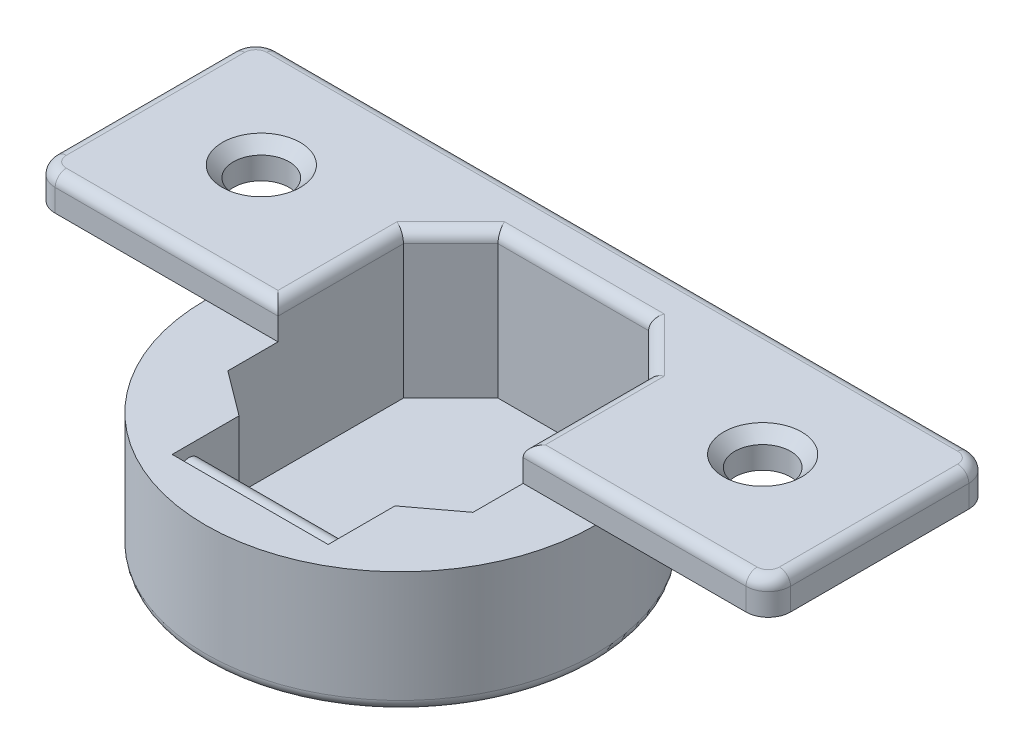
ISO-10303-21;
HEADER;
FILE_DESCRIPTION(('STEP AP214'),'2;1');
FILE_NAME('part.step','',(''),(''),'','','');
FILE_SCHEMA(('AUTOMOTIVE_DESIGN { 1 0 10303 214 1 1 1 1 }'));
ENDSEC;
DATA;
#1=APPLICATION_CONTEXT('core data for automotive mechanical design processes');
#2=APPLICATION_PROTOCOL_DEFINITION('international standard','automotive_design',2000,#1);
#3=PRODUCT_CONTEXT('',#1,'mechanical');
#4=PRODUCT('Part','Part','',(#3));
#5=PRODUCT_RELATED_PRODUCT_CATEGORY('part','',(#4));
#6=PRODUCT_DEFINITION_FORMATION('','',#4);
#7=PRODUCT_DEFINITION_CONTEXT('part definition',#1,'design');
#8=PRODUCT_DEFINITION('design','',#6,#7);
#9=PRODUCT_DEFINITION_SHAPE('','',#8);
#10=(LENGTH_UNIT() NAMED_UNIT(*) SI_UNIT(.MILLI.,.METRE.));
#11=(NAMED_UNIT(*) PLANE_ANGLE_UNIT() SI_UNIT($,.RADIAN.));
#12=(NAMED_UNIT(*) SI_UNIT($,.STERADIAN.) SOLID_ANGLE_UNIT());
#13=UNCERTAINTY_MEASURE_WITH_UNIT(LENGTH_MEASURE(1.E-05),#10,'distance_accuracy_value','');
#14=(GEOMETRIC_REPRESENTATION_CONTEXT(3) GLOBAL_UNCERTAINTY_ASSIGNED_CONTEXT((#13)) GLOBAL_UNIT_ASSIGNED_CONTEXT((#10,
#11,#12)) REPRESENTATION_CONTEXT('',''));
#15=CARTESIAN_POINT('',(0.,0.,0.));
#16=DIRECTION('',(0.,0.,1.));
#17=DIRECTION('',(1.,0.,0.));
#18=AXIS2_PLACEMENT_3D('',#15,#16,#17);
#19=CARTESIAN_POINT('',(7.,0.999999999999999,7.5));
#20=DIRECTION('',(1.,0.,0.));
#21=DIRECTION('',(0.,0.,-1.));
#22=AXIS2_PLACEMENT_3D('',#19,#20,#21);
#23=PLANE('',#22);
#24=CARTESIAN_POINT('',(7.,9.,12.));
#25=DIRECTION('',(1.,0.,0.));
#26=DIRECTION('',(0.,0.,-1.));
#27=AXIS2_PLACEMENT_3D('',#24,#25,#26);
#28=CIRCLE('',#27,1.);
#29=CARTESIAN_POINT('',(7.00000000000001,9.,13.));
#30=VERTEX_POINT('',#29);
#31=EDGE_CURVE('E385',#30,#30,#28,.F.);
#32=ORIENTED_EDGE('',*,*,#31,.F.);
#33=EDGE_LOOP('',(#32));
#34=FACE_BOUND('',#33,.T.);
#35=CARTESIAN_POINT('',(7.,5.,8.00000000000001));
#36=DIRECTION('',(1.,0.,0.));
#37=DIRECTION('',(0.,0.,-1.));
#38=AXIS2_PLACEMENT_3D('',#35,#36,#37);
#39=CIRCLE('',#38,1.);
#40=CARTESIAN_POINT('',(7.,5.86602540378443,7.5));
#41=VERTEX_POINT('',#40);
#42=CARTESIAN_POINT('',(7.,4.13397459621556,7.5));
#43=VERTEX_POINT('',#42);
#44=EDGE_CURVE('E258',#41,#43,#39,.T.);
#45=ORIENTED_EDGE('',*,*,#44,.T.);
#46=DIRECTION('',(0.,1.,0.));
#47=VECTOR('',#46,1.);
#48=CARTESIAN_POINT('',(7.,0.999999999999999,7.5));
#49=LINE('',#48,#47);
#50=CARTESIAN_POINT('',(7.,0.999999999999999,7.5));
#51=VERTEX_POINT('',#50);
#52=EDGE_CURVE('E292',#51,#43,#49,.T.);
#53=ORIENTED_EDGE('',*,*,#52,.F.);
#54=DIRECTION('',(0.,0.,-1.));
#55=VECTOR('',#54,1.);
#56=CARTESIAN_POINT('',(7.,0.999999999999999,7.5));
#57=LINE('',#56,#55);
#58=CARTESIAN_POINT('',(7.00000000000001,0.999999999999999,13.5));
#59=VERTEX_POINT('',#58);
#60=EDGE_CURVE('E288',#59,#51,#57,.T.);
#61=ORIENTED_EDGE('',*,*,#60,.F.);
#62=DIRECTION('',(0.,1.,0.));
#63=VECTOR('',#62,1.);
#64=CARTESIAN_POINT('',(7.00000000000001,0.999999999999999,13.5));
#65=LINE('',#64,#63);
#66=CARTESIAN_POINT('',(7.00000000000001,11.,13.5));
#67=VERTEX_POINT('',#66);
#68=EDGE_CURVE('E298',#59,#67,#65,.T.);
#69=ORIENTED_EDGE('',*,*,#68,.T.);
#70=DIRECTION('',(0.,0.,-1.));
#71=VECTOR('',#70,1.);
#72=CARTESIAN_POINT('',(7.,11.,0.));
#73=LINE('',#72,#71);
#74=CARTESIAN_POINT('',(7.,11.,7.5));
#75=VERTEX_POINT('',#74);
#76=EDGE_CURVE('E374',#67,#75,#73,.T.);
#77=ORIENTED_EDGE('',*,*,#76,.T.);
#78=EDGE_CURVE('E297',#41,#75,#49,.T.);
#79=ORIENTED_EDGE('',*,*,#78,.F.);
#80=EDGE_LOOP('',(#45,#53,#61,#69,#77,#79));
#81=FACE_BOUND('',#80,.T.);
#82=ADVANCED_FACE('F32',(#34,#81),#23,.F.);
#83=CARTESIAN_POINT('',(-6.99999999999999,0.999999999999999,7.50000000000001));
#84=DIRECTION('',(-1.,0.,0.));
#85=DIRECTION('',(0.,0.,1.));
#86=AXIS2_PLACEMENT_3D('',#83,#84,#85);
#87=PLANE('',#86);
#88=CARTESIAN_POINT('',(-6.99999999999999,9.,12.));
#89=DIRECTION('',(-1.,0.,0.));
#90=DIRECTION('',(0.,0.,1.));
#91=AXIS2_PLACEMENT_3D('',#88,#89,#90);
#92=CIRCLE('',#91,1.);
#93=CARTESIAN_POINT('',(-6.99999999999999,9.,13.));
#94=VERTEX_POINT('',#93);
#95=EDGE_CURVE('E382',#94,#94,#92,.F.);
#96=ORIENTED_EDGE('',*,*,#95,.F.);
#97=EDGE_LOOP('',(#96));
#98=FACE_BOUND('',#97,.T.);
#99=CARTESIAN_POINT('',(-6.99999999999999,5.,8.00000000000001));
#100=DIRECTION('',(-1.,0.,0.));
#101=DIRECTION('',(0.,0.,1.));
#102=AXIS2_PLACEMENT_3D('',#99,#100,#101);
#103=CIRCLE('',#102,1.);
#104=CARTESIAN_POINT('',(-6.99999999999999,5.86602540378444,7.5));
#105=VERTEX_POINT('',#104);
#106=CARTESIAN_POINT('',(-6.99999999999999,4.13397459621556,7.50000000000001));
#107=VERTEX_POINT('',#106);
#108=EDGE_CURVE('E244',#105,#107,#103,.F.);
#109=ORIENTED_EDGE('',*,*,#108,.F.);
#110=DIRECTION('',(0.,1.,0.));
#111=VECTOR('',#110,1.);
#112=CARTESIAN_POINT('',(-6.99999999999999,0.999999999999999,7.50000000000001));
#113=LINE('',#112,#111);
#114=CARTESIAN_POINT('',(-6.99999999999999,11.,7.50000000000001));
#115=VERTEX_POINT('',#114);
#116=EDGE_CURVE('E229',#105,#115,#113,.T.);
#117=ORIENTED_EDGE('',*,*,#116,.T.);
#118=DIRECTION('',(0.,0.,1.));
#119=VECTOR('',#118,1.);
#120=CARTESIAN_POINT('',(-6.99999999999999,11.,0.));
#121=LINE('',#120,#119);
#122=CARTESIAN_POINT('',(-6.99999999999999,11.,13.5));
#123=VERTEX_POINT('',#122);
#124=EDGE_CURVE('E379',#115,#123,#121,.T.);
#125=ORIENTED_EDGE('',*,*,#124,.T.);
#126=DIRECTION('',(0.,1.,0.));
#127=VECTOR('',#126,1.);
#128=CARTESIAN_POINT('',(-6.99999999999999,0.999999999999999,13.5));
#129=LINE('',#128,#127);
#130=CARTESIAN_POINT('',(-6.99999999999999,0.999999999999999,13.5));
#131=VERTEX_POINT('',#130);
#132=EDGE_CURVE('E301',#131,#123,#129,.T.);
#133=ORIENTED_EDGE('',*,*,#132,.F.);
#134=DIRECTION('',(0.,0.,1.));
#135=VECTOR('',#134,1.);
#136=CARTESIAN_POINT('',(-6.99999999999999,0.999999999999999,7.50000000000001));
#137=LINE('',#136,#135);
#138=CARTESIAN_POINT('',(-6.99999999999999,0.999999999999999,7.50000000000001));
#139=VERTEX_POINT('',#138);
#140=EDGE_CURVE('E282',#139,#131,#137,.T.);
#141=ORIENTED_EDGE('',*,*,#140,.F.);
#142=EDGE_CURVE('E242',#139,#107,#113,.T.);
#143=ORIENTED_EDGE('',*,*,#142,.T.);
#144=EDGE_LOOP('',(#109,#117,#125,#133,#141,#143));
#145=FACE_BOUND('',#144,.T.);
#146=ADVANCED_FACE('F245',(#98,#145),#87,.F.);
#147=CARTESIAN_POINT('',(31.,14.,0.));
#148=DIRECTION('',(0.,0.,-1.));
#149=DIRECTION('',(-1.,0.,0.));
#150=AXIS2_PLACEMENT_3D('',#147,#148,#149);
#151=PLANE('',#150);
#152=DIRECTION('',(0.,1.,0.));
#153=VECTOR('',#152,1.);
#154=CARTESIAN_POINT('',(-11.,14.,0.));
#155=LINE('',#154,#153);
#156=CARTESIAN_POINT('',(-11.,11.,0.));
#157=VERTEX_POINT('',#156);
#158=CARTESIAN_POINT('',(-11.,13.,0.));
#159=VERTEX_POINT('',#158);
#160=EDGE_CURVE('E321',#157,#159,#155,.T.);
#161=ORIENTED_EDGE('',*,*,#160,.T.);
#162=DIRECTION('',(1.,0.,0.));
#163=VECTOR('',#162,1.);
#164=CARTESIAN_POINT('',(31.,13.,0.));
#165=LINE('',#164,#163);
#166=CARTESIAN_POINT('',(-31.,13.,0.));
#167=VERTEX_POINT('',#166);
#168=EDGE_CURVE('E442',#159,#167,#165,.F.);
#169=ORIENTED_EDGE('',*,*,#168,.T.);
#170=DIRECTION('',(0.,-1.,0.));
#171=VECTOR('',#170,1.);
#172=CARTESIAN_POINT('',(-31.,14.,0.));
#173=LINE('',#172,#171);
#174=CARTESIAN_POINT('',(-31.,11.,0.));
#175=VERTEX_POINT('',#174);
#176=EDGE_CURVE('E358',#167,#175,#173,.T.);
#177=ORIENTED_EDGE('',*,*,#176,.T.);
#178=DIRECTION('',(1.,0.,0.));
#179=VECTOR('',#178,1.);
#180=CARTESIAN_POINT('',(31.,11.,0.));
#181=LINE('',#180,#179);
#182=CARTESIAN_POINT('',(-17.5,11.,0.));
#183=VERTEX_POINT('',#182);
#184=EDGE_CURVE('E341',#175,#183,#181,.T.);
#185=ORIENTED_EDGE('',*,*,#184,.T.);
#186=EDGE_CURVE('E346',#183,#157,#181,.T.);
#187=ORIENTED_EDGE('',*,*,#186,.T.);
#188=EDGE_LOOP('',(#161,#169,#177,#185,#187));
#189=FACE_BOUND('',#188,.T.);
#190=ADVANCED_FACE('F546',(#189),#151,.F.);
#191=CARTESIAN_POINT('',(0.,11.,0.));
#192=DIRECTION('',(0.,-1.,0.));
#193=DIRECTION('',(0.,0.,-1.));
#194=AXIS2_PLACEMENT_3D('',#191,#192,#193);
#195=CYLINDRICAL_SURFACE('',#194,17.5);
#196=CARTESIAN_POINT('',(0.,1.,0.));
#197=DIRECTION('',(0.,1.,0.));
#198=DIRECTION('',(0.,0.,1.));
#199=AXIS2_PLACEMENT_3D('',#196,#197,#198);
#200=CIRCLE('',#199,17.5);
#201=CARTESIAN_POINT('',(0.,1.,17.5));
#202=VERTEX_POINT('',#201);
#203=EDGE_CURVE('E444',#202,#202,#200,.T.);
#204=ORIENTED_EDGE('',*,*,#203,.T.);
#205=EDGE_LOOP('',(#204));
#206=FACE_BOUND('',#205,.T.);
#207=CARTESIAN_POINT('',(0.,11.,0.));
#208=DIRECTION('',(0.,1.,0.));
#209=DIRECTION('',(0.,0.,1.));
#210=AXIS2_PLACEMENT_3D('',#207,#208,#209);
#211=CIRCLE('',#210,17.5);
#212=CARTESIAN_POINT('',(17.5,11.,0.));
#213=VERTEX_POINT('',#212);
#214=EDGE_CURVE('E369',#213,#183,#211,.T.);
#215=ORIENTED_EDGE('',*,*,#214,.F.);
#216=EDGE_CURVE('E368',#183,#213,#211,.T.);
#217=ORIENTED_EDGE('',*,*,#216,.F.);
#218=EDGE_LOOP('',(#215,#217));
#219=FACE_BOUND('',#218,.T.);
#220=ADVANCED_FACE('F542',(#206,#219),#195,.T.);
#221=CARTESIAN_POINT('',(0.,11.,0.));
#222=DIRECTION('',(0.,1.,0.));
#223=DIRECTION('',(0.,0.,1.));
#224=AXIS2_PLACEMENT_3D('',#221,#222,#223);
#225=PLANE('',#224);
#226=DIRECTION('',(0.,0.,1.));
#227=VECTOR('',#226,1.);
#228=CARTESIAN_POINT('',(-11.,11.,0.));
#229=LINE('',#228,#227);
#230=CARTESIAN_POINT('',(-11.,11.,4.50000000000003));
#231=VERTEX_POINT('',#230);
#232=EDGE_CURVE('E323',#157,#231,#229,.T.);
#233=ORIENTED_EDGE('',*,*,#232,.F.);
#234=ORIENTED_EDGE('',*,*,#186,.F.);
#235=ORIENTED_EDGE('',*,*,#216,.T.);
#236=CARTESIAN_POINT('',(11.,11.,0.));
#237=VERTEX_POINT('',#236);
#238=EDGE_CURVE('E345',#237,#213,#181,.T.);
#239=ORIENTED_EDGE('',*,*,#238,.F.);
#240=DIRECTION('',(0.,0.,-1.));
#241=VECTOR('',#240,1.);
#242=CARTESIAN_POINT('',(11.,11.,0.));
#243=LINE('',#242,#241);
#244=CARTESIAN_POINT('',(11.,11.,4.50000000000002));
#245=VERTEX_POINT('',#244);
#246=EDGE_CURVE('E318',#245,#237,#243,.T.);
#247=ORIENTED_EDGE('',*,*,#246,.F.);
#248=DIRECTION('',(0.800000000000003,0.,-0.599999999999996));
#249=VECTOR('',#248,1.);
#250=CARTESIAN_POINT('',(6.11999999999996,11.,8.16000000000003));
#251=LINE('',#250,#249);
#252=EDGE_CURVE('E372',#75,#245,#251,.T.);
#253=ORIENTED_EDGE('',*,*,#252,.F.);
#254=ORIENTED_EDGE('',*,*,#76,.F.);
#255=DIRECTION('',(1.,0.,0.));
#256=VECTOR('',#255,1.);
#257=CARTESIAN_POINT('',(0.,11.,13.5));
#258=LINE('',#257,#256);
#259=EDGE_CURVE('E377',#123,#67,#258,.T.);
#260=ORIENTED_EDGE('',*,*,#259,.F.);
#261=ORIENTED_EDGE('',*,*,#124,.F.);
#262=DIRECTION('',(0.800000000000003,0.,0.599999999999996));
#263=VECTOR('',#262,1.);
#264=CARTESIAN_POINT('',(-6.11999999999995,11.,8.16000000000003));
#265=LINE('',#264,#263);
#266=EDGE_CURVE('E237',#231,#115,#265,.T.);
#267=ORIENTED_EDGE('',*,*,#266,.F.);
#268=EDGE_LOOP('',(#233,#234,#235,#239,#247,#253,#254,#260,#261,#267));
#269=FACE_BOUND('',#268,.T.);
#270=ADVANCED_FACE('F544',(#269),#225,.T.);
#271=CARTESIAN_POINT('',(0.,0.,0.));
#272=DIRECTION('',(0.,1.,0.));
#273=DIRECTION('',(0.,0.,1.));
#274=AXIS2_PLACEMENT_3D('',#271,#272,#273);
#275=PLANE('',#274);
#276=CARTESIAN_POINT('',(0.,0.,0.));
#277=DIRECTION('',(0.,1.,0.));
#278=DIRECTION('',(0.,0.,1.));
#279=AXIS2_PLACEMENT_3D('',#276,#277,#278);
#280=CIRCLE('',#279,16.5);
#281=CARTESIAN_POINT('',(0.,0.,16.5));
#282=VERTEX_POINT('',#281);
#283=EDGE_CURVE('E487',#282,#282,#280,.F.);
#284=ORIENTED_EDGE('',*,*,#283,.T.);
#285=EDGE_LOOP('',(#284));
#286=FACE_BOUND('',#285,.T.);
#287=ADVANCED_FACE('F723',(#286),#275,.F.);
#288=CARTESIAN_POINT('',(31.,14.,-18.));
#289=DIRECTION('',(0.,-1.,0.));
#290=DIRECTION('',(0.,0.,-1.));
#291=AXIS2_PLACEMENT_3D('',#288,#289,#290);
#292=CYLINDRICAL_SURFACE('',#291,2.);
#293=DIRECTION('',(0.,-1.,0.));
#294=VECTOR('',#293,1.);
#295=CARTESIAN_POINT('',(31.,14.,-20.));
#296=LINE('',#295,#294);
#297=CARTESIAN_POINT('',(31.,13.,-20.));
#298=VERTEX_POINT('',#297);
#299=CARTESIAN_POINT('',(31.,11.,-20.));
#300=VERTEX_POINT('',#299);
#301=EDGE_CURVE('E366',#298,#300,#296,.T.);
#302=ORIENTED_EDGE('',*,*,#301,.F.);
#303=CARTESIAN_POINT('',(31.,13.,-18.));
#304=DIRECTION('',(0.,-1.,0.));
#305=DIRECTION('',(0.,0.,-1.));
#306=AXIS2_PLACEMENT_3D('',#303,#304,#305);
#307=CIRCLE('',#306,2.);
#308=CARTESIAN_POINT('',(33.,13.,-18.));
#309=VERTEX_POINT('',#308);
#310=EDGE_CURVE('E426',#298,#309,#307,.T.);
#311=ORIENTED_EDGE('',*,*,#310,.T.);
#312=DIRECTION('',(0.,-1.,0.));
#313=VECTOR('',#312,1.);
#314=CARTESIAN_POINT('',(33.,14.,-18.));
#315=LINE('',#314,#313);
#316=CARTESIAN_POINT('',(33.,11.,-18.));
#317=VERTEX_POINT('',#316);
#318=EDGE_CURVE('E352',#309,#317,#315,.T.);
#319=ORIENTED_EDGE('',*,*,#318,.T.);
#320=CARTESIAN_POINT('',(31.,11.,-18.));
#321=DIRECTION('',(0.,1.,0.));
#322=DIRECTION('',(0.,0.,-1.));
#323=AXIS2_PLACEMENT_3D('',#320,#321,#322);
#324=CIRCLE('',#323,2.);
#325=EDGE_CURVE('E325',#317,#300,#324,.T.);
#326=ORIENTED_EDGE('',*,*,#325,.T.);
#327=EDGE_LOOP('',(#302,#311,#319,#326));
#328=FACE_BOUND('',#327,.T.);
#329=ADVANCED_FACE('F569',(#328),#292,.T.);
#330=CARTESIAN_POINT('',(31.,14.,-20.));
#331=DIRECTION('',(0.,0.,1.));
#332=DIRECTION('',(1.,0.,0.));
#333=AXIS2_PLACEMENT_3D('',#330,#331,#332);
#334=PLANE('',#333);
#335=DIRECTION('',(0.,-1.,0.));
#336=VECTOR('',#335,1.);
#337=CARTESIAN_POINT('',(-31.,14.,-20.));
#338=LINE('',#337,#336);
#339=CARTESIAN_POINT('',(-31.,13.,-20.));
#340=VERTEX_POINT('',#339);
#341=CARTESIAN_POINT('',(-31.,11.,-20.));
#342=VERTEX_POINT('',#341);
#343=EDGE_CURVE('E364',#340,#342,#338,.T.);
#344=ORIENTED_EDGE('',*,*,#343,.F.);
#345=DIRECTION('',(-1.,0.,0.));
#346=VECTOR('',#345,1.);
#347=CARTESIAN_POINT('',(31.,13.,-20.));
#348=LINE('',#347,#346);
#349=EDGE_CURVE('E424',#340,#298,#348,.F.);
#350=ORIENTED_EDGE('',*,*,#349,.T.);
#351=ORIENTED_EDGE('',*,*,#301,.T.);
#352=DIRECTION('',(-1.,0.,0.));
#353=VECTOR('',#352,1.);
#354=CARTESIAN_POINT('',(31.,11.,-20.));
#355=LINE('',#354,#353);
#356=EDGE_CURVE('E328',#300,#342,#355,.T.);
#357=ORIENTED_EDGE('',*,*,#356,.T.);
#358=EDGE_LOOP('',(#344,#350,#351,#357));
#359=FACE_BOUND('',#358,.T.);
#360=ADVANCED_FACE('F656',(#359),#334,.F.);
#361=CARTESIAN_POINT('',(-31.,14.,-18.));
#362=DIRECTION('',(0.,-1.,0.));
#363=DIRECTION('',(0.,0.,-1.));
#364=AXIS2_PLACEMENT_3D('',#361,#362,#363);
#365=CYLINDRICAL_SURFACE('',#364,2.);
#366=DIRECTION('',(0.,-1.,0.));
#367=VECTOR('',#366,1.);
#368=CARTESIAN_POINT('',(-33.,14.,-18.));
#369=LINE('',#368,#367);
#370=CARTESIAN_POINT('',(-33.,13.,-18.));
#371=VERTEX_POINT('',#370);
#372=CARTESIAN_POINT('',(-33.,11.,-18.));
#373=VERTEX_POINT('',#372);
#374=EDGE_CURVE('E362',#371,#373,#369,.T.);
#375=ORIENTED_EDGE('',*,*,#374,.F.);
#376=CARTESIAN_POINT('',(-31.,13.,-18.));
#377=DIRECTION('',(0.,-1.,0.));
#378=DIRECTION('',(0.,0.,-1.));
#379=AXIS2_PLACEMENT_3D('',#376,#377,#378);
#380=CIRCLE('',#379,2.);
#381=EDGE_CURVE('E422',#371,#340,#380,.T.);
#382=ORIENTED_EDGE('',*,*,#381,.T.);
#383=ORIENTED_EDGE('',*,*,#343,.T.);
#384=CARTESIAN_POINT('',(-31.,11.,-18.));
#385=DIRECTION('',(0.,1.,0.));
#386=DIRECTION('',(0.,0.,1.));
#387=AXIS2_PLACEMENT_3D('',#384,#385,#386);
#388=CIRCLE('',#387,2.);
#389=EDGE_CURVE('E331',#342,#373,#388,.T.);
#390=ORIENTED_EDGE('',*,*,#389,.T.);
#391=EDGE_LOOP('',(#375,#382,#383,#390));
#392=FACE_BOUND('',#391,.T.);
#393=ADVANCED_FACE('F562',(#392),#365,.T.);
#394=CARTESIAN_POINT('',(-33.,14.,-18.));
#395=DIRECTION('',(1.,0.,0.));
#396=DIRECTION('',(0.,0.,-1.));
#397=AXIS2_PLACEMENT_3D('',#394,#395,#396);
#398=PLANE('',#397);
#399=DIRECTION('',(0.,-1.,0.));
#400=VECTOR('',#399,1.);
#401=CARTESIAN_POINT('',(-33.,14.,-2.00000000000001));
#402=LINE('',#401,#400);
#403=CARTESIAN_POINT('',(-33.,13.,-2.00000000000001));
#404=VERTEX_POINT('',#403);
#405=CARTESIAN_POINT('',(-33.,11.,-2.00000000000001));
#406=VERTEX_POINT('',#405);
#407=EDGE_CURVE('E360',#404,#406,#402,.T.);
#408=ORIENTED_EDGE('',*,*,#407,.F.);
#409=DIRECTION('',(0.,0.,1.));
#410=VECTOR('',#409,1.);
#411=CARTESIAN_POINT('',(-33.,13.,-18.));
#412=LINE('',#411,#410);
#413=EDGE_CURVE('E420',#404,#371,#412,.F.);
#414=ORIENTED_EDGE('',*,*,#413,.T.);
#415=ORIENTED_EDGE('',*,*,#374,.T.);
#416=DIRECTION('',(0.,0.,1.));
#417=VECTOR('',#416,1.);
#418=CARTESIAN_POINT('',(-33.,11.,-18.));
#419=LINE('',#418,#417);
#420=EDGE_CURVE('E334',#373,#406,#419,.T.);
#421=ORIENTED_EDGE('',*,*,#420,.T.);
#422=EDGE_LOOP('',(#408,#414,#415,#421));
#423=FACE_BOUND('',#422,.T.);
#424=ADVANCED_FACE('F557',(#423),#398,.F.);
#425=CARTESIAN_POINT('',(-31.,14.,-2.));
#426=DIRECTION('',(0.,-1.,0.));
#427=DIRECTION('',(0.,0.,-1.));
#428=AXIS2_PLACEMENT_3D('',#425,#426,#427);
#429=CYLINDRICAL_SURFACE('',#428,2.);
#430=ORIENTED_EDGE('',*,*,#176,.F.);
#431=CARTESIAN_POINT('',(-31.,13.,-2.));
#432=DIRECTION('',(0.,-1.,0.));
#433=DIRECTION('',(0.,0.,-1.));
#434=AXIS2_PLACEMENT_3D('',#431,#432,#433);
#435=CIRCLE('',#434,2.);
#436=EDGE_CURVE('E417',#167,#404,#435,.T.);
#437=ORIENTED_EDGE('',*,*,#436,.T.);
#438=ORIENTED_EDGE('',*,*,#407,.T.);
#439=CARTESIAN_POINT('',(-31.,11.,-2.));
#440=DIRECTION('',(0.,1.,0.));
#441=DIRECTION('',(0.,0.,-1.));
#442=AXIS2_PLACEMENT_3D('',#439,#440,#441);
#443=CIRCLE('',#442,2.);
#444=EDGE_CURVE('E337',#406,#175,#443,.T.);
#445=ORIENTED_EDGE('',*,*,#444,.T.);
#446=EDGE_LOOP('',(#430,#437,#438,#445));
#447=FACE_BOUND('',#446,.T.);
#448=ADVANCED_FACE('F553',(#447),#429,.T.);
#449=DIRECTION('',(0.,-1.,0.));
#450=VECTOR('',#449,1.);
#451=CARTESIAN_POINT('',(31.,14.,0.));
#452=LINE('',#451,#450);
#453=CARTESIAN_POINT('',(31.,13.,0.));
#454=VERTEX_POINT('',#453);
#455=CARTESIAN_POINT('',(31.,11.,0.));
#456=VERTEX_POINT('',#455);
#457=EDGE_CURVE('E356',#454,#456,#452,.T.);
#458=ORIENTED_EDGE('',*,*,#457,.F.);
#459=DIRECTION('',(1.,0.,0.));
#460=VECTOR('',#459,1.);
#461=CARTESIAN_POINT('',(31.,13.,0.));
#462=LINE('',#461,#460);
#463=CARTESIAN_POINT('',(11.,13.,0.));
#464=VERTEX_POINT('',#463);
#465=EDGE_CURVE('E432',#454,#464,#462,.F.);
#466=ORIENTED_EDGE('',*,*,#465,.T.);
#467=DIRECTION('',(0.,-1.,0.));
#468=VECTOR('',#467,1.);
#469=CARTESIAN_POINT('',(11.,14.,0.));
#470=LINE('',#469,#468);
#471=EDGE_CURVE('E295',#464,#237,#470,.T.);
#472=ORIENTED_EDGE('',*,*,#471,.T.);
#473=ORIENTED_EDGE('',*,*,#238,.T.);
#474=EDGE_CURVE('E340',#213,#456,#181,.T.);
#475=ORIENTED_EDGE('',*,*,#474,.T.);
#476=EDGE_LOOP('',(#458,#466,#472,#473,#475));
#477=FACE_BOUND('',#476,.T.);
#478=ADVANCED_FACE('F535',(#477),#151,.F.);
#479=CARTESIAN_POINT('',(31.,14.,-2.00000000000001));
#480=DIRECTION('',(0.,-1.,0.));
#481=DIRECTION('',(0.,0.,-1.));
#482=AXIS2_PLACEMENT_3D('',#479,#480,#481);
#483=CYLINDRICAL_SURFACE('',#482,2.);
#484=DIRECTION('',(0.,-1.,0.));
#485=VECTOR('',#484,1.);
#486=CARTESIAN_POINT('',(33.,14.,-2.00000000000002));
#487=LINE('',#486,#485);
#488=CARTESIAN_POINT('',(33.,13.,-2.00000000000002));
#489=VERTEX_POINT('',#488);
#490=CARTESIAN_POINT('',(33.,11.,-2.00000000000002));
#491=VERTEX_POINT('',#490);
#492=EDGE_CURVE('E354',#489,#491,#487,.T.);
#493=ORIENTED_EDGE('',*,*,#492,.F.);
#494=CARTESIAN_POINT('',(31.,13.,-2.00000000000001));
#495=DIRECTION('',(0.,-1.,0.));
#496=DIRECTION('',(0.,0.,-1.));
#497=AXIS2_PLACEMENT_3D('',#494,#495,#496);
#498=CIRCLE('',#497,2.);
#499=EDGE_CURVE('E430',#489,#454,#498,.T.);
#500=ORIENTED_EDGE('',*,*,#499,.T.);
#501=ORIENTED_EDGE('',*,*,#457,.T.);
#502=CARTESIAN_POINT('',(31.,11.,-2.00000000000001));
#503=DIRECTION('',(0.,1.,0.));
#504=DIRECTION('',(0.,0.,-1.));
#505=AXIS2_PLACEMENT_3D('',#502,#503,#504);
#506=CIRCLE('',#505,2.);
#507=EDGE_CURVE('E344',#456,#491,#506,.T.);
#508=ORIENTED_EDGE('',*,*,#507,.T.);
#509=EDGE_LOOP('',(#493,#500,#501,#508));
#510=FACE_BOUND('',#509,.T.);
#511=ADVANCED_FACE('F578',(#510),#483,.T.);
#512=CARTESIAN_POINT('',(33.,14.,-18.));
#513=DIRECTION('',(-1.,0.,0.));
#514=DIRECTION('',(0.,0.,1.));
#515=AXIS2_PLACEMENT_3D('',#512,#513,#514);
#516=PLANE('',#515);
#517=ORIENTED_EDGE('',*,*,#318,.F.);
#518=DIRECTION('',(0.,0.,-1.));
#519=VECTOR('',#518,1.);
#520=CARTESIAN_POINT('',(33.,13.,-18.));
#521=LINE('',#520,#519);
#522=EDGE_CURVE('E428',#309,#489,#521,.F.);
#523=ORIENTED_EDGE('',*,*,#522,.T.);
#524=ORIENTED_EDGE('',*,*,#492,.T.);
#525=DIRECTION('',(0.,0.,-1.));
#526=VECTOR('',#525,1.);
#527=CARTESIAN_POINT('',(33.,11.,-18.));
#528=LINE('',#527,#526);
#529=EDGE_CURVE('E349',#491,#317,#528,.T.);
#530=ORIENTED_EDGE('',*,*,#529,.T.);
#531=EDGE_LOOP('',(#517,#523,#524,#530));
#532=FACE_BOUND('',#531,.T.);
#533=ADVANCED_FACE('F574',(#532),#516,.F.);
#534=CARTESIAN_POINT('',(31.,14.,-18.));
#535=DIRECTION('',(0.,-1.,0.));
#536=DIRECTION('',(0.,0.,-1.));
#537=AXIS2_PLACEMENT_3D('',#534,#535,#536);
#538=PLANE('',#537);
#539=CARTESIAN_POINT('',(22.5,14.,-10.));
#540=DIRECTION('',(0.,-1.,0.));
#541=DIRECTION('',(0.,0.,-1.));
#542=AXIS2_PLACEMENT_3D('',#539,#540,#541);
#543=CIRCLE('',#542,3.50000000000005);
#544=CARTESIAN_POINT('',(22.5,14.,-13.5000000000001));
#545=VERTEX_POINT('',#544);
#546=EDGE_CURVE('E40',#545,#545,#543,.T.);
#547=ORIENTED_EDGE('',*,*,#546,.T.);
#548=EDGE_LOOP('',(#547));
#549=FACE_BOUND('',#548,.T.);
#550=CARTESIAN_POINT('',(-22.5,14.,-10.));
#551=DIRECTION('',(0.,-1.,0.));
#552=DIRECTION('',(0.,0.,-1.));
#553=AXIS2_PLACEMENT_3D('',#550,#551,#552);
#554=CIRCLE('',#553,3.50000000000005);
#555=CARTESIAN_POINT('',(-22.5,14.,-13.5000000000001));
#556=VERTEX_POINT('',#555);
#557=EDGE_CURVE('E498',#556,#556,#554,.T.);
#558=ORIENTED_EDGE('',*,*,#557,.T.);
#559=EDGE_LOOP('',(#558));
#560=FACE_BOUND('',#559,.T.);
#561=DIRECTION('',(0.,0.,1.));
#562=VECTOR('',#561,1.);
#563=CARTESIAN_POINT('',(-32.,14.,-18.));
#564=LINE('',#563,#562);
#565=CARTESIAN_POINT('',(-32.,14.,-18.));
#566=VERTEX_POINT('',#565);
#567=CARTESIAN_POINT('',(-32.,14.,-2.));
#568=VERTEX_POINT('',#567);
#569=EDGE_CURVE('E412',#566,#568,#564,.T.);
#570=ORIENTED_EDGE('',*,*,#569,.T.);
#571=CARTESIAN_POINT('',(-31.,14.,-2.));
#572=DIRECTION('',(0.,-1.,0.));
#573=DIRECTION('',(0.,0.,-1.));
#574=AXIS2_PLACEMENT_3D('',#571,#572,#573);
#575=CIRCLE('',#574,1.);
#576=CARTESIAN_POINT('',(-31.,14.,-0.999999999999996));
#577=VERTEX_POINT('',#576);
#578=EDGE_CURVE('E414',#568,#577,#575,.F.);
#579=ORIENTED_EDGE('',*,*,#578,.T.);
#580=DIRECTION('',(1.,0.,0.));
#581=VECTOR('',#580,1.);
#582=CARTESIAN_POINT('',(31.,14.,-1.));
#583=LINE('',#582,#581);
#584=CARTESIAN_POINT('',(-12.,14.,-0.999999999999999));
#585=VERTEX_POINT('',#584);
#586=EDGE_CURVE('E388',#577,#585,#583,.T.);
#587=ORIENTED_EDGE('',*,*,#586,.T.);
#588=DIRECTION('',(0.,0.,1.));
#589=VECTOR('',#588,1.);
#590=CARTESIAN_POINT('',(-12.,14.,-18.));
#591=LINE('',#590,#589);
#592=CARTESIAN_POINT('',(-12.,14.,-11.6715728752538));
#593=VERTEX_POINT('',#592);
#594=EDGE_CURVE('E390',#585,#593,#591,.F.);
#595=ORIENTED_EDGE('',*,*,#594,.T.);
#596=DIRECTION('',(-0.707106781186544,0.,0.707106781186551));
#597=VECTOR('',#596,1.);
#598=CARTESIAN_POINT('',(12.6642135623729,14.,-36.3357864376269));
#599=LINE('',#598,#597);
#600=CARTESIAN_POINT('',(-7.17157287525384,14.,-16.5));
#601=VERTEX_POINT('',#600);
#602=EDGE_CURVE('E392',#593,#601,#599,.F.);
#603=ORIENTED_EDGE('',*,*,#602,.T.);
#604=DIRECTION('',(-1.,0.,0.));
#605=VECTOR('',#604,1.);
#606=CARTESIAN_POINT('',(31.,14.,-16.5));
#607=LINE('',#606,#605);
#608=CARTESIAN_POINT('',(7.17157287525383,14.,-16.5));
#609=VERTEX_POINT('',#608);
#610=EDGE_CURVE('E394',#601,#609,#607,.F.);
#611=ORIENTED_EDGE('',*,*,#610,.T.);
#612=DIRECTION('',(-0.707106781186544,0.,-0.707106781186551));
#613=VECTOR('',#612,1.);
#614=CARTESIAN_POINT('',(18.3357864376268,14.,-5.33578643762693));
#615=LINE('',#614,#613);
#616=CARTESIAN_POINT('',(12.,14.,-11.6715728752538));
#617=VERTEX_POINT('',#616);
#618=EDGE_CURVE('E396',#609,#617,#615,.F.);
#619=ORIENTED_EDGE('',*,*,#618,.T.);
#620=DIRECTION('',(0.,0.,1.));
#621=VECTOR('',#620,1.);
#622=CARTESIAN_POINT('',(12.,14.,-18.));
#623=LINE('',#622,#621);
#624=CARTESIAN_POINT('',(12.,14.,-1.));
#625=VERTEX_POINT('',#624);
#626=EDGE_CURVE('E398',#617,#625,#623,.T.);
#627=ORIENTED_EDGE('',*,*,#626,.T.);
#628=DIRECTION('',(1.,0.,0.));
#629=VECTOR('',#628,1.);
#630=CARTESIAN_POINT('',(31.,14.,-1.));
#631=LINE('',#630,#629);
#632=CARTESIAN_POINT('',(31.,14.,-1.));
#633=VERTEX_POINT('',#632);
#634=EDGE_CURVE('E400',#625,#633,#631,.T.);
#635=ORIENTED_EDGE('',*,*,#634,.T.);
#636=CARTESIAN_POINT('',(31.,14.,-2.00000000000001));
#637=DIRECTION('',(0.,-1.,0.));
#638=DIRECTION('',(0.,0.,-1.));
#639=AXIS2_PLACEMENT_3D('',#636,#637,#638);
#640=CIRCLE('',#639,1.);
#641=CARTESIAN_POINT('',(32.,14.,-2.00000000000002));
#642=VERTEX_POINT('',#641);
#643=EDGE_CURVE('E402',#633,#642,#640,.F.);
#644=ORIENTED_EDGE('',*,*,#643,.T.);
#645=DIRECTION('',(0.,0.,-1.));
#646=VECTOR('',#645,1.);
#647=CARTESIAN_POINT('',(32.,14.,-18.));
#648=LINE('',#647,#646);
#649=CARTESIAN_POINT('',(32.,14.,-18.));
#650=VERTEX_POINT('',#649);
#651=EDGE_CURVE('E404',#642,#650,#648,.T.);
#652=ORIENTED_EDGE('',*,*,#651,.T.);
#653=CARTESIAN_POINT('',(31.,14.,-18.));
#654=DIRECTION('',(0.,-1.,0.));
#655=DIRECTION('',(0.,0.,-1.));
#656=AXIS2_PLACEMENT_3D('',#653,#654,#655);
#657=CIRCLE('',#656,0.999999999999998);
#658=CARTESIAN_POINT('',(31.,14.,-19.));
#659=VERTEX_POINT('',#658);
#660=EDGE_CURVE('E406',#650,#659,#657,.F.);
#661=ORIENTED_EDGE('',*,*,#660,.T.);
#662=DIRECTION('',(-1.,0.,0.));
#663=VECTOR('',#662,1.);
#664=CARTESIAN_POINT('',(31.,14.,-19.));
#665=LINE('',#664,#663);
#666=CARTESIAN_POINT('',(-31.,14.,-19.));
#667=VERTEX_POINT('',#666);
#668=EDGE_CURVE('E408',#659,#667,#665,.T.);
#669=ORIENTED_EDGE('',*,*,#668,.T.);
#670=CARTESIAN_POINT('',(-31.,14.,-18.));
#671=DIRECTION('',(0.,-1.,0.));
#672=DIRECTION('',(0.,0.,-1.));
#673=AXIS2_PLACEMENT_3D('',#670,#671,#672);
#674=CIRCLE('',#673,0.999999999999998);
#675=EDGE_CURVE('E410',#667,#566,#674,.F.);
#676=ORIENTED_EDGE('',*,*,#675,.T.);
#677=EDGE_LOOP('',(#570,#579,#587,#595,#603,#611,#619,#627,#635,#644,#652,#661,#669,#676));
#678=FACE_BOUND('',#677,.T.);
#679=ADVANCED_FACE('F503',(#549,#560,#678),#538,.F.);
#680=CARTESIAN_POINT('',(31.,11.,-18.));
#681=DIRECTION('',(0.,-1.,0.));
#682=DIRECTION('',(0.,0.,-1.));
#683=AXIS2_PLACEMENT_3D('',#680,#681,#682);
#684=PLANE('',#683);
#685=CARTESIAN_POINT('',(22.5,11.,-10.));
#686=DIRECTION('',(0.,-1.,0.));
#687=DIRECTION('',(0.,0.,-1.));
#688=AXIS2_PLACEMENT_3D('',#685,#686,#687);
#689=CIRCLE('',#688,2.5);
#690=CARTESIAN_POINT('',(22.5,11.,-7.50000000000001));
#691=VERTEX_POINT('',#690);
#692=EDGE_CURVE('E493',#691,#691,#689,.T.);
#693=ORIENTED_EDGE('',*,*,#692,.F.);
#694=EDGE_LOOP('',(#693));
#695=FACE_BOUND('',#694,.T.);
#696=CARTESIAN_POINT('',(-22.5,11.,-10.));
#697=DIRECTION('',(0.,-1.,0.));
#698=DIRECTION('',(0.,0.,-1.));
#699=AXIS2_PLACEMENT_3D('',#696,#697,#698);
#700=CIRCLE('',#699,2.5);
#701=CARTESIAN_POINT('',(-22.5,11.,-7.5));
#702=VERTEX_POINT('',#701);
#703=EDGE_CURVE('E448',#702,#702,#700,.T.);
#704=ORIENTED_EDGE('',*,*,#703,.F.);
#705=EDGE_LOOP('',(#704));
#706=FACE_BOUND('',#705,.T.);
#707=ORIENTED_EDGE('',*,*,#474,.F.);
#708=ORIENTED_EDGE('',*,*,#214,.T.);
#709=ORIENTED_EDGE('',*,*,#184,.F.);
#710=ORIENTED_EDGE('',*,*,#444,.F.);
#711=ORIENTED_EDGE('',*,*,#420,.F.);
#712=ORIENTED_EDGE('',*,*,#389,.F.);
#713=ORIENTED_EDGE('',*,*,#356,.F.);
#714=ORIENTED_EDGE('',*,*,#325,.F.);
#715=ORIENTED_EDGE('',*,*,#529,.F.);
#716=ORIENTED_EDGE('',*,*,#507,.F.);
#717=EDGE_LOOP('',(#707,#708,#709,#710,#711,#712,#713,#714,#715,#716));
#718=FACE_BOUND('',#717,.T.);
#719=ADVANCED_FACE('F518',(#695,#706,#718),#684,.T.);
#720=CARTESIAN_POINT('',(11.,0.999999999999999,4.50000000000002));
#721=DIRECTION('',(0.599999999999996,0.,0.800000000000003));
#722=DIRECTION('',(0.800000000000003,0.,-0.599999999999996));
#723=AXIS2_PLACEMENT_3D('',#720,#721,#722);
#724=PLANE('',#723);
#725=ORIENTED_EDGE('',*,*,#252,.T.);
#726=DIRECTION('',(0.,1.,0.));
#727=VECTOR('',#726,1.);
#728=CARTESIAN_POINT('',(11.,0.999999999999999,4.50000000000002));
#729=LINE('',#728,#727);
#730=CARTESIAN_POINT('',(11.,0.999999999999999,4.50000000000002));
#731=VERTEX_POINT('',#730);
#732=EDGE_CURVE('E291',#731,#245,#729,.T.);
#733=ORIENTED_EDGE('',*,*,#732,.F.);
#734=DIRECTION('',(0.800000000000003,0.,-0.599999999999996));
#735=VECTOR('',#734,1.);
#736=CARTESIAN_POINT('',(11.,0.999999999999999,4.50000000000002));
#737=LINE('',#736,#735);
#738=EDGE_CURVE('E262',#51,#731,#737,.T.);
#739=ORIENTED_EDGE('',*,*,#738,.F.);
#740=ORIENTED_EDGE('',*,*,#52,.T.);
#741=EDGE_CURVE('E296',#43,#41,#49,.T.);
#742=ORIENTED_EDGE('',*,*,#741,.T.);
#743=ORIENTED_EDGE('',*,*,#78,.T.);
#744=EDGE_LOOP('',(#725,#733,#739,#740,#742,#743));
#745=FACE_BOUND('',#744,.T.);
#746=ADVANCED_FACE('F521',(#745),#724,.F.);
#747=CARTESIAN_POINT('',(-6.99999999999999,0.999999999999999,13.5));
#748=DIRECTION('',(0.,0.,1.));
#749=DIRECTION('',(1.,0.,0.));
#750=AXIS2_PLACEMENT_3D('',#747,#748,#749);
#751=PLANE('',#750);
#752=ORIENTED_EDGE('',*,*,#259,.T.);
#753=ORIENTED_EDGE('',*,*,#68,.F.);
#754=DIRECTION('',(1.,0.,0.));
#755=VECTOR('',#754,1.);
#756=CARTESIAN_POINT('',(-6.99999999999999,0.999999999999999,13.5));
#757=LINE('',#756,#755);
#758=EDGE_CURVE('E285',#131,#59,#757,.T.);
#759=ORIENTED_EDGE('',*,*,#758,.F.);
#760=ORIENTED_EDGE('',*,*,#132,.T.);
#761=EDGE_LOOP('',(#752,#753,#759,#760));
#762=FACE_BOUND('',#761,.T.);
#763=ADVANCED_FACE('F618',(#762),#751,.F.);
#764=CARTESIAN_POINT('',(-11.,0.999999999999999,4.50000000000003));
#765=DIRECTION('',(-0.599999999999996,0.,0.800000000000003));
#766=DIRECTION('',(0.800000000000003,0.,0.599999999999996));
#767=AXIS2_PLACEMENT_3D('',#764,#765,#766);
#768=PLANE('',#767);
#769=ORIENTED_EDGE('',*,*,#266,.T.);
#770=ORIENTED_EDGE('',*,*,#116,.F.);
#771=EDGE_CURVE('E233',#107,#105,#113,.T.);
#772=ORIENTED_EDGE('',*,*,#771,.F.);
#773=ORIENTED_EDGE('',*,*,#142,.F.);
#774=DIRECTION('',(0.800000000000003,0.,0.599999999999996));
#775=VECTOR('',#774,1.);
#776=CARTESIAN_POINT('',(-11.,0.999999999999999,4.50000000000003));
#777=LINE('',#776,#775);
#778=CARTESIAN_POINT('',(-11.,0.999999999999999,4.50000000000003));
#779=VERTEX_POINT('',#778);
#780=EDGE_CURVE('E279',#779,#139,#777,.T.);
#781=ORIENTED_EDGE('',*,*,#780,.F.);
#782=DIRECTION('',(0.,1.,0.));
#783=VECTOR('',#782,1.);
#784=CARTESIAN_POINT('',(-11.,0.999999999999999,4.50000000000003));
#785=LINE('',#784,#783);
#786=EDGE_CURVE('E240',#779,#231,#785,.T.);
#787=ORIENTED_EDGE('',*,*,#786,.T.);
#788=EDGE_LOOP('',(#769,#770,#772,#773,#781,#787));
#789=FACE_BOUND('',#788,.T.);
#790=ADVANCED_FACE('F231',(#789),#768,.F.);
#791=CARTESIAN_POINT('',(-11.,0.999999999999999,-11.2573593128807));
#792=DIRECTION('',(-1.,0.,0.));
#793=DIRECTION('',(0.,0.,1.));
#794=AXIS2_PLACEMENT_3D('',#791,#792,#793);
#795=PLANE('',#794);
#796=DIRECTION('',(0.,1.,0.));
#797=VECTOR('',#796,1.);
#798=CARTESIAN_POINT('',(-11.,0.999999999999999,-11.2573593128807));
#799=LINE('',#798,#797);
#800=CARTESIAN_POINT('',(-11.,0.999999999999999,-11.2573593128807));
#801=VERTEX_POINT('',#800);
#802=CARTESIAN_POINT('',(-11.,13.,-11.2573593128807));
#803=VERTEX_POINT('',#802);
#804=EDGE_CURVE('E305',#801,#803,#799,.T.);
#805=ORIENTED_EDGE('',*,*,#804,.T.);
#806=DIRECTION('',(0.,0.,1.));
#807=VECTOR('',#806,1.);
#808=CARTESIAN_POINT('',(-11.,13.,-11.2573593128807));
#809=LINE('',#808,#807);
#810=EDGE_CURVE('E47',#803,#159,#809,.T.);
#811=ORIENTED_EDGE('',*,*,#810,.T.);
#812=ORIENTED_EDGE('',*,*,#160,.F.);
#813=ORIENTED_EDGE('',*,*,#232,.T.);
#814=ORIENTED_EDGE('',*,*,#786,.F.);
#815=DIRECTION('',(0.,0.,1.));
#816=VECTOR('',#815,1.);
#817=CARTESIAN_POINT('',(-11.,0.999999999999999,-11.2573593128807));
#818=LINE('',#817,#816);
#819=EDGE_CURVE('E276',#801,#779,#818,.T.);
#820=ORIENTED_EDGE('',*,*,#819,.F.);
#821=EDGE_LOOP('',(#805,#811,#812,#813,#814,#820));
#822=FACE_BOUND('',#821,.T.);
#823=ADVANCED_FACE('F621',(#822),#795,.F.);
#824=CARTESIAN_POINT('',(-11.,0.999999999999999,-11.2573593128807));
#825=DIRECTION('',(-0.707106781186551,0.,-0.707106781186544));
#826=DIRECTION('',(-0.707106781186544,0.,0.707106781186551));
#827=AXIS2_PLACEMENT_3D('',#824,#825,#826);
#828=PLANE('',#827);
#829=DIRECTION('',(0.,1.,0.));
#830=VECTOR('',#829,1.);
#831=CARTESIAN_POINT('',(-6.75735931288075,0.999999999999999,-15.5));
#832=LINE('',#831,#830);
#833=CARTESIAN_POINT('',(-6.75735931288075,0.999999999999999,-15.5));
#834=VERTEX_POINT('',#833);
#835=CARTESIAN_POINT('',(-6.75735931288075,13.,-15.5));
#836=VERTEX_POINT('',#835);
#837=EDGE_CURVE('E307',#834,#836,#832,.T.);
#838=ORIENTED_EDGE('',*,*,#837,.T.);
#839=DIRECTION('',(-0.707106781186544,0.,0.707106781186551));
#840=VECTOR('',#839,1.);
#841=CARTESIAN_POINT('',(-11.,13.,-11.2573593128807));
#842=LINE('',#841,#840);
#843=EDGE_CURVE('E55',#836,#803,#842,.T.);
#844=ORIENTED_EDGE('',*,*,#843,.T.);
#845=ORIENTED_EDGE('',*,*,#804,.F.);
#846=DIRECTION('',(-0.707106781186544,0.,0.707106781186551));
#847=VECTOR('',#846,1.);
#848=CARTESIAN_POINT('',(-11.,0.999999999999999,-11.2573593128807));
#849=LINE('',#848,#847);
#850=EDGE_CURVE('E273',#834,#801,#849,.T.);
#851=ORIENTED_EDGE('',*,*,#850,.F.);
#852=EDGE_LOOP('',(#838,#844,#845,#851));
#853=FACE_BOUND('',#852,.T.);
#854=ADVANCED_FACE('F625',(#853),#828,.F.);
#855=CARTESIAN_POINT('',(-6.75735931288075,0.999999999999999,-15.5));
#856=DIRECTION('',(0.,0.,-1.));
#857=DIRECTION('',(-1.,0.,0.));
#858=AXIS2_PLACEMENT_3D('',#855,#856,#857);
#859=PLANE('',#858);
#860=DIRECTION('',(0.,1.,0.));
#861=VECTOR('',#860,1.);
#862=CARTESIAN_POINT('',(6.75735931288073,0.999999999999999,-15.5));
#863=LINE('',#862,#861);
#864=CARTESIAN_POINT('',(6.75735931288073,0.999999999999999,-15.5));
#865=VERTEX_POINT('',#864);
#866=CARTESIAN_POINT('',(6.75735931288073,13.,-15.5));
#867=VERTEX_POINT('',#866);
#868=EDGE_CURVE('E309',#865,#867,#863,.T.);
#869=ORIENTED_EDGE('',*,*,#868,.T.);
#870=DIRECTION('',(-1.,0.,0.));
#871=VECTOR('',#870,1.);
#872=CARTESIAN_POINT('',(-6.75735931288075,13.,-15.5));
#873=LINE('',#872,#871);
#874=EDGE_CURVE('E438',#867,#836,#873,.T.);
#875=ORIENTED_EDGE('',*,*,#874,.T.);
#876=ORIENTED_EDGE('',*,*,#837,.F.);
#877=DIRECTION('',(-1.,0.,0.));
#878=VECTOR('',#877,1.);
#879=CARTESIAN_POINT('',(6.75735931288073,0.999999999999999,-15.5));
#880=LINE('',#879,#878);
#881=EDGE_CURVE('E271',#865,#834,#880,.T.);
#882=ORIENTED_EDGE('',*,*,#881,.F.);
#883=EDGE_LOOP('',(#869,#875,#876,#882));
#884=FACE_BOUND('',#883,.T.);
#885=ADVANCED_FACE('F696',(#884),#859,.F.);
#886=CARTESIAN_POINT('',(11.,0.999999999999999,-11.2573593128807));
#887=DIRECTION('',(0.707106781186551,0.,-0.707106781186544));
#888=DIRECTION('',(-0.707106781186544,0.,-0.707106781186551));
#889=AXIS2_PLACEMENT_3D('',#886,#887,#888);
#890=PLANE('',#889);
#891=DIRECTION('',(0.,1.,0.));
#892=VECTOR('',#891,1.);
#893=CARTESIAN_POINT('',(11.,0.999999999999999,-11.2573593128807));
#894=LINE('',#893,#892);
#895=CARTESIAN_POINT('',(11.,0.999999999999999,-11.2573593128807));
#896=VERTEX_POINT('',#895);
#897=CARTESIAN_POINT('',(11.,13.,-11.2573593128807));
#898=VERTEX_POINT('',#897);
#899=EDGE_CURVE('E312',#896,#898,#894,.T.);
#900=ORIENTED_EDGE('',*,*,#899,.T.);
#901=DIRECTION('',(-0.707106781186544,0.,-0.707106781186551));
#902=VECTOR('',#901,1.);
#903=CARTESIAN_POINT('',(11.,13.,-11.2573593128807));
#904=LINE('',#903,#902);
#905=EDGE_CURVE('E436',#898,#867,#904,.T.);
#906=ORIENTED_EDGE('',*,*,#905,.T.);
#907=ORIENTED_EDGE('',*,*,#868,.F.);
#908=DIRECTION('',(-0.707106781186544,0.,-0.707106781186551));
#909=VECTOR('',#908,1.);
#910=CARTESIAN_POINT('',(11.,0.999999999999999,-11.2573593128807));
#911=LINE('',#910,#909);
#912=EDGE_CURVE('E268',#896,#865,#911,.T.);
#913=ORIENTED_EDGE('',*,*,#912,.F.);
#914=EDGE_LOOP('',(#900,#906,#907,#913));
#915=FACE_BOUND('',#914,.T.);
#916=ADVANCED_FACE('F603',(#915),#890,.F.);
#917=CARTESIAN_POINT('',(11.,0.999999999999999,-11.2573593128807));
#918=DIRECTION('',(1.,0.,0.));
#919=DIRECTION('',(0.,0.,-1.));
#920=AXIS2_PLACEMENT_3D('',#917,#918,#919);
#921=PLANE('',#920);
#922=ORIENTED_EDGE('',*,*,#471,.F.);
#923=DIRECTION('',(0.,0.,1.));
#924=VECTOR('',#923,1.);
#925=CARTESIAN_POINT('',(11.,13.,-11.2573593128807));
#926=LINE('',#925,#924);
#927=EDGE_CURVE('E434',#464,#898,#926,.F.);
#928=ORIENTED_EDGE('',*,*,#927,.T.);
#929=ORIENTED_EDGE('',*,*,#899,.F.);
#930=DIRECTION('',(0.,0.,-1.));
#931=VECTOR('',#930,1.);
#932=CARTESIAN_POINT('',(11.,0.999999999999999,-11.2573593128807));
#933=LINE('',#932,#931);
#934=EDGE_CURVE('E265',#731,#896,#933,.T.);
#935=ORIENTED_EDGE('',*,*,#934,.F.);
#936=ORIENTED_EDGE('',*,*,#732,.T.);
#937=ORIENTED_EDGE('',*,*,#246,.T.);
#938=EDGE_LOOP('',(#922,#928,#929,#935,#936,#937));
#939=FACE_BOUND('',#938,.T.);
#940=ADVANCED_FACE('F599',(#939),#921,.F.);
#941=CARTESIAN_POINT('',(20.0042053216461,0.999999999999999,-2.25315399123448));
#942=DIRECTION('',(0.,-1.,0.));
#943=DIRECTION('',(0.,0.,-1.));
#944=AXIS2_PLACEMENT_3D('',#941,#942,#943);
#945=PLANE('',#944);
#946=ORIENTED_EDGE('',*,*,#738,.T.);
#947=ORIENTED_EDGE('',*,*,#934,.T.);
#948=ORIENTED_EDGE('',*,*,#912,.T.);
#949=ORIENTED_EDGE('',*,*,#881,.T.);
#950=ORIENTED_EDGE('',*,*,#850,.T.);
#951=ORIENTED_EDGE('',*,*,#819,.T.);
#952=ORIENTED_EDGE('',*,*,#780,.T.);
#953=ORIENTED_EDGE('',*,*,#140,.T.);
#954=ORIENTED_EDGE('',*,*,#758,.T.);
#955=ORIENTED_EDGE('',*,*,#60,.T.);
#956=EDGE_LOOP('',(#946,#947,#948,#949,#950,#951,#952,#953,#954,#955));
#957=FACE_BOUND('',#956,.T.);
#958=ADVANCED_FACE('F606',(#957),#945,.F.);
#959=CARTESIAN_POINT('',(9.8284271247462,9.,12.));
#960=DIRECTION('',(-1.,0.,0.));
#961=DIRECTION('',(0.,0.,1.));
#962=AXIS2_PLACEMENT_3D('',#959,#960,#961);
#963=CYLINDRICAL_SURFACE('',#962,1.);
#964=CARTESIAN_POINT('',(7.00000000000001,9.,13.));
#965=CARTESIAN_POINT('',(6.85416666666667,9.,13.));
#966=CARTESIAN_POINT('',(6.70833333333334,9.,13.));
#967=CARTESIAN_POINT('',(6.41666666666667,9.,13.));
#968=CARTESIAN_POINT('',(6.27083333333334,9.,13.));
#969=CARTESIAN_POINT('',(5.97916666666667,9.,13.));
#970=CARTESIAN_POINT('',(5.83333333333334,9.,13.));
#971=CARTESIAN_POINT('',(5.54166666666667,9.,13.));
#972=CARTESIAN_POINT('',(5.39583333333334,9.,13.));
#973=CARTESIAN_POINT('',(5.10416666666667,9.,13.));
#974=CARTESIAN_POINT('',(4.95833333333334,9.,13.));
#975=CARTESIAN_POINT('',(4.66666666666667,9.,13.));
#976=CARTESIAN_POINT('',(4.52083333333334,9.,13.));
#977=CARTESIAN_POINT('',(4.22916666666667,9.,13.));
#978=CARTESIAN_POINT('',(4.08333333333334,9.,13.));
#979=CARTESIAN_POINT('',(3.79166666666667,9.,13.));
#980=CARTESIAN_POINT('',(3.64583333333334,9.,13.));
#981=CARTESIAN_POINT('',(3.35416666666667,9.,13.));
#982=CARTESIAN_POINT('',(3.20833333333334,9.,13.));
#983=CARTESIAN_POINT('',(2.91666666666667,9.,13.));
#984=CARTESIAN_POINT('',(2.77083333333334,9.,13.));
#985=CARTESIAN_POINT('',(2.47916666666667,9.,13.));
#986=CARTESIAN_POINT('',(2.33333333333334,9.,13.));
#987=CARTESIAN_POINT('',(2.04166666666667,9.,13.));
#988=CARTESIAN_POINT('',(1.89583333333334,9.,13.));
#989=CARTESIAN_POINT('',(1.60416666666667,9.,13.));
#990=CARTESIAN_POINT('',(1.45833333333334,9.,13.));
#991=CARTESIAN_POINT('',(1.16666666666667,9.,13.));
#992=CARTESIAN_POINT('',(1.02083333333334,9.,13.));
#993=CARTESIAN_POINT('',(0.729166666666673,9.,13.));
#994=CARTESIAN_POINT('',(0.58333333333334,9.,13.));
#995=CARTESIAN_POINT('',(0.291666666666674,9.,13.));
#996=CARTESIAN_POINT('',(0.14583333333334,9.,13.));
#997=CARTESIAN_POINT('',(-0.145833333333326,9.,13.));
#998=CARTESIAN_POINT('',(-0.29166666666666,9.,13.));
#999=CARTESIAN_POINT('',(-0.583333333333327,9.,13.));
#1000=CARTESIAN_POINT('',(-0.72916666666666,9.,13.));
#1001=CARTESIAN_POINT('',(-1.02083333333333,9.,13.));
#1002=CARTESIAN_POINT('',(-1.16666666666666,9.,13.));
#1003=CARTESIAN_POINT('',(-1.45833333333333,9.,13.));
#1004=CARTESIAN_POINT('',(-1.60416666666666,9.,13.));
#1005=CARTESIAN_POINT('',(-1.89583333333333,9.,13.));
#1006=CARTESIAN_POINT('',(-2.04166666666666,9.,13.));
#1007=CARTESIAN_POINT('',(-2.33333333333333,9.,13.));
#1008=CARTESIAN_POINT('',(-2.47916666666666,9.,13.));
#1009=CARTESIAN_POINT('',(-2.77083333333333,9.,13.));
#1010=CARTESIAN_POINT('',(-2.91666666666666,9.,13.));
#1011=CARTESIAN_POINT('',(-3.20833333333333,9.,13.));
#1012=CARTESIAN_POINT('',(-3.35416666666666,9.,13.));
#1013=CARTESIAN_POINT('',(-3.64583333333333,9.,13.));
#1014=CARTESIAN_POINT('',(-3.79166666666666,9.,13.));
#1015=CARTESIAN_POINT('',(-4.08333333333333,9.,13.));
#1016=CARTESIAN_POINT('',(-4.22916666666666,9.,13.));
#1017=CARTESIAN_POINT('',(-4.52083333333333,9.,13.));
#1018=CARTESIAN_POINT('',(-4.66666666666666,9.,13.));
#1019=CARTESIAN_POINT('',(-4.95833333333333,9.,13.));
#1020=CARTESIAN_POINT('',(-5.10416666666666,9.,13.));
#1021=CARTESIAN_POINT('',(-5.39583333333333,9.,13.));
#1022=CARTESIAN_POINT('',(-5.54166666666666,9.,13.));
#1023=CARTESIAN_POINT('',(-5.83333333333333,9.,13.));
#1024=CARTESIAN_POINT('',(-5.97916666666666,9.,13.));
#1025=CARTESIAN_POINT('',(-6.27083333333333,9.,13.));
#1026=CARTESIAN_POINT('',(-6.41666666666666,9.,13.));
#1027=CARTESIAN_POINT('',(-6.70833333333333,9.,13.));
#1028=CARTESIAN_POINT('',(-6.85416666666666,9.,13.));
#1029=CARTESIAN_POINT('',(-6.99999999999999,9.,13.));
#1030=B_SPLINE_CURVE_WITH_KNOTS('',3,(#964,#965,#966,#967,#968,#969,#970,#971,#972,#973,#974,
#975,#976,#977,#978,#979,#980,#981,#982,#983,#984,#985,#986,#987,#988,#989,#990,#991,#992,#993,
#994,#995,#996,#997,#998,#999,#1000,#1001,#1002,#1003,#1004,#1005,#1006,#1007,#1008,#1009,#1010,
#1011,#1012,#1013,#1014,#1015,#1016,#1017,#1018,#1019,#1020,#1021,#1022,#1023,#1024,#1025,#1026,
#1027,#1028,#1029),.UNSPECIFIED.,.F.,.F.,(4,2,2,2,2,2,2,2,2,2,2,2,2,2,2,2,2,2,2,2,2,2,2,2,2,2,2,
2,2,2,2,2,4),(0.,0.4375,0.875,1.3125,1.75,2.1875,2.625,3.0625,3.5,3.9375,4.375,4.8125,5.25,
5.6875,6.125,6.5625,7.,7.4375,7.875,8.3125,8.75,9.1875,9.625,10.0625,10.5,10.9375,11.375,
11.8125,12.25,12.6875,13.125,13.5625,14.),.UNSPECIFIED.);
#1031=EDGE_CURVE('BSEAM899',#30,#94,#1030,.T.);
#1032=ORIENTED_EDGE('',*,*,#31,.T.);
#1033=ORIENTED_EDGE('',*,*,#95,.T.);
#1034=ORIENTED_EDGE('',*,*,#1031,.T.);
#1035=ORIENTED_EDGE('',*,*,#1031,.F.);
#1036=EDGE_LOOP('',(#1032,#1034,#1033,#1035));
#1037=FACE_BOUND('',#1036,.T.);
#1038=ADVANCED_FACE('F899',(#1037),#963,.T.);
#1039=CARTESIAN_POINT('',(7.,0.999999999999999,7.5));
#1040=DIRECTION('',(1.,0.,0.));
#1041=DIRECTION('',(0.,0.,-1.));
#1042=AXIS2_PLACEMENT_3D('',#1039,#1040,#1041);
#1043=PLANE('',#1042);
#1044=ORIENTED_EDGE('',*,*,#741,.F.);
#1045=EDGE_CURVE('E256',#43,#41,#39,.T.);
#1046=ORIENTED_EDGE('',*,*,#1045,.T.);
#1047=EDGE_LOOP('',(#1044,#1046));
#1048=FACE_BOUND('',#1047,.T.);
#1049=ADVANCED_FACE('F891',(#1048),#1043,.T.);
#1050=CARTESIAN_POINT('',(-6.99999999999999,0.999999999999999,7.50000000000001));
#1051=DIRECTION('',(-1.,0.,0.));
#1052=DIRECTION('',(0.,0.,1.));
#1053=AXIS2_PLACEMENT_3D('',#1050,#1051,#1052);
#1054=PLANE('',#1053);
#1055=ORIENTED_EDGE('',*,*,#771,.T.);
#1056=EDGE_CURVE('E250',#107,#105,#103,.F.);
#1057=ORIENTED_EDGE('',*,*,#1056,.F.);
#1058=EDGE_LOOP('',(#1055,#1057));
#1059=FACE_BOUND('',#1058,.T.);
#1060=ADVANCED_FACE('F254',(#1059),#1054,.T.);
#1061=CARTESIAN_POINT('',(9.8284271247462,5.,8.00000000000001));
#1062=DIRECTION('',(-1.,0.,0.));
#1063=DIRECTION('',(0.,0.,1.));
#1064=AXIS2_PLACEMENT_3D('',#1061,#1062,#1063);
#1065=CYLINDRICAL_SURFACE('',#1064,1.);
#1066=ORIENTED_EDGE('',*,*,#44,.F.);
#1067=ORIENTED_EDGE('',*,*,#1045,.F.);
#1068=EDGE_LOOP('',(#1066,#1067));
#1069=FACE_BOUND('',#1068,.T.);
#1070=ORIENTED_EDGE('',*,*,#1056,.T.);
#1071=ORIENTED_EDGE('',*,*,#108,.T.);
#1072=EDGE_LOOP('',(#1070,#1071));
#1073=FACE_BOUND('',#1072,.T.);
#1074=ADVANCED_FACE('F255',(#1069,#1073),#1065,.T.);
#1075=CARTESIAN_POINT('',(31.,13.,-1.));
#1076=DIRECTION('',(1.,0.,0.));
#1077=DIRECTION('',(0.,0.,-1.));
#1078=AXIS2_PLACEMENT_3D('',#1075,#1076,#1077);
#1079=CYLINDRICAL_SURFACE('',#1078,1.);
#1080=CARTESIAN_POINT('',(12.,13.,-1.));
#1081=DIRECTION('',(0.707106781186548,0.,0.707106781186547));
#1082=DIRECTION('',(-0.707106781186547,0.,0.707106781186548));
#1083=AXIS2_PLACEMENT_3D('',#1080,#1081,#1082);
#1084=ELLIPSE('',#1083,1.41421356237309,1.);
#1085=EDGE_CURVE('E480',#464,#625,#1084,.F.);
#1086=ORIENTED_EDGE('',*,*,#1085,.F.);
#1087=ORIENTED_EDGE('',*,*,#465,.F.);
#1088=CARTESIAN_POINT('',(31.,13.,-1.));
#1089=DIRECTION('',(1.,0.,0.));
#1090=DIRECTION('',(0.,0.,-1.));
#1091=AXIS2_PLACEMENT_3D('',#1088,#1089,#1090);
#1092=CIRCLE('',#1091,1.);
#1093=EDGE_CURVE('E251',#633,#454,#1092,.T.);
#1094=ORIENTED_EDGE('',*,*,#1093,.F.);
#1095=ORIENTED_EDGE('',*,*,#634,.F.);
#1096=EDGE_LOOP('',(#1086,#1087,#1094,#1095));
#1097=FACE_BOUND('',#1096,.T.);
#1098=ADVANCED_FACE('F583',(#1097),#1079,.T.);
#1099=CARTESIAN_POINT('',(31.,13.,-2.00000000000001));
#1100=DIRECTION('',(0.,-1.,0.));
#1101=DIRECTION('',(0.,0.,-1.));
#1102=AXIS2_PLACEMENT_3D('',#1099,#1100,#1101);
#1103=TOROIDAL_SURFACE('',#1102,1.,1.);
#1104=ORIENTED_EDGE('',*,*,#1093,.T.);
#1105=ORIENTED_EDGE('',*,*,#499,.F.);
#1106=CARTESIAN_POINT('',(32.,13.,-2.00000000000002));
#1107=DIRECTION('',(0.,0.,-1.));
#1108=DIRECTION('',(-1.,0.,0.));
#1109=AXIS2_PLACEMENT_3D('',#1106,#1107,#1108);
#1110=CIRCLE('',#1109,1.);
#1111=EDGE_CURVE('E477',#642,#489,#1110,.T.);
#1112=ORIENTED_EDGE('',*,*,#1111,.F.);
#1113=ORIENTED_EDGE('',*,*,#643,.F.);
#1114=EDGE_LOOP('',(#1104,#1105,#1112,#1113));
#1115=FACE_BOUND('',#1114,.T.);
#1116=ADVANCED_FACE('F588',(#1115),#1103,.T.);
#1117=CARTESIAN_POINT('',(12.,13.,-18.));
#1118=DIRECTION('',(0.,0.,1.));
#1119=DIRECTION('',(1.,0.,0.));
#1120=AXIS2_PLACEMENT_3D('',#1117,#1118,#1119);
#1121=CYLINDRICAL_SURFACE('',#1120,1.);
#1122=ORIENTED_EDGE('',*,*,#1085,.T.);
#1123=ORIENTED_EDGE('',*,*,#626,.F.);
#1124=CARTESIAN_POINT('',(12.,13.,-11.6715728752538));
#1125=DIRECTION('',(0.382683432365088,0.,0.923879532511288));
#1126=DIRECTION('',(-0.923879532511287,0.,0.382683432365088));
#1127=AXIS2_PLACEMENT_3D('',#1124,#1125,#1126);
#1128=ELLIPSE('',#1127,1.08239220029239,1.);
#1129=EDGE_CURVE('E474',#898,#617,#1128,.F.);
#1130=ORIENTED_EDGE('',*,*,#1129,.F.);
#1131=ORIENTED_EDGE('',*,*,#927,.F.);
#1132=EDGE_LOOP('',(#1122,#1123,#1130,#1131));
#1133=FACE_BOUND('',#1132,.T.);
#1134=ADVANCED_FACE('F595',(#1133),#1121,.T.);
#1135=CARTESIAN_POINT('',(32.,13.,-18.));
#1136=DIRECTION('',(0.,0.,-1.));
#1137=DIRECTION('',(-1.,0.,0.));
#1138=AXIS2_PLACEMENT_3D('',#1135,#1136,#1137);
#1139=CYLINDRICAL_SURFACE('',#1138,1.);
#1140=ORIENTED_EDGE('',*,*,#1111,.T.);
#1141=ORIENTED_EDGE('',*,*,#522,.F.);
#1142=CARTESIAN_POINT('',(32.,13.,-18.));
#1143=DIRECTION('',(0.,0.,-1.));
#1144=DIRECTION('',(-1.,0.,0.));
#1145=AXIS2_PLACEMENT_3D('',#1142,#1143,#1144);
#1146=CIRCLE('',#1145,1.);
#1147=EDGE_CURVE('E471',#650,#309,#1146,.T.);
#1148=ORIENTED_EDGE('',*,*,#1147,.F.);
#1149=ORIENTED_EDGE('',*,*,#651,.F.);
#1150=EDGE_LOOP('',(#1140,#1141,#1148,#1149));
#1151=FACE_BOUND('',#1150,.T.);
#1152=ADVANCED_FACE('F665',(#1151),#1139,.T.);
#1153=CARTESIAN_POINT('',(11.7071067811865,13.,-11.9644660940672));
#1154=DIRECTION('',(-0.707106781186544,0.,-0.707106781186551));
#1155=DIRECTION('',(-0.707106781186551,0.,0.707106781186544));
#1156=AXIS2_PLACEMENT_3D('',#1153,#1154,#1155);
#1157=CYLINDRICAL_SURFACE('',#1156,1.);
#1158=ORIENTED_EDGE('',*,*,#1129,.T.);
#1159=ORIENTED_EDGE('',*,*,#618,.F.);
#1160=CARTESIAN_POINT('',(7.17157287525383,13.,-16.5));
#1161=DIRECTION('',(-0.923879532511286,0.,-0.382683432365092));
#1162=DIRECTION('',(0.382683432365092,0.,-0.923879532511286));
#1163=AXIS2_PLACEMENT_3D('',#1160,#1161,#1162);
#1164=ELLIPSE('',#1163,1.0823922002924,1.);
#1165=EDGE_CURVE('E468',#867,#609,#1164,.T.);
#1166=ORIENTED_EDGE('',*,*,#1165,.F.);
#1167=ORIENTED_EDGE('',*,*,#905,.F.);
#1168=EDGE_LOOP('',(#1158,#1159,#1166,#1167));
#1169=FACE_BOUND('',#1168,.T.);
#1170=ADVANCED_FACE('F667',(#1169),#1157,.T.);
#1171=CARTESIAN_POINT('',(31.,13.,-18.));
#1172=DIRECTION('',(0.,-1.,0.));
#1173=DIRECTION('',(0.,0.,-1.));
#1174=AXIS2_PLACEMENT_3D('',#1171,#1172,#1173);
#1175=DEGENERATE_TOROIDAL_SURFACE('',#1174,0.999999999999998,1.,.T.);
#1176=ORIENTED_EDGE('',*,*,#1147,.T.);
#1177=ORIENTED_EDGE('',*,*,#310,.F.);
#1178=CARTESIAN_POINT('',(31.,13.,-19.));
#1179=DIRECTION('',(-1.,0.,0.));
#1180=DIRECTION('',(0.,0.,1.));
#1181=AXIS2_PLACEMENT_3D('',#1178,#1179,#1180);
#1182=CIRCLE('',#1181,1.);
#1183=EDGE_CURVE('E465',#659,#298,#1182,.T.);
#1184=ORIENTED_EDGE('',*,*,#1183,.F.);
#1185=ORIENTED_EDGE('',*,*,#660,.F.);
#1186=EDGE_LOOP('',(#1176,#1177,#1184,#1185));
#1187=FACE_BOUND('',#1186,.T.);
#1188=ADVANCED_FACE('F663',(#1187),#1175,.T.);
#1189=CARTESIAN_POINT('',(-6.75735931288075,13.,-16.5));
#1190=DIRECTION('',(-1.,0.,0.));
#1191=DIRECTION('',(0.,0.,1.));
#1192=AXIS2_PLACEMENT_3D('',#1189,#1190,#1191);
#1193=CYLINDRICAL_SURFACE('',#1192,1.);
#1194=ORIENTED_EDGE('',*,*,#1165,.T.);
#1195=ORIENTED_EDGE('',*,*,#610,.F.);
#1196=CARTESIAN_POINT('',(-7.17157287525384,13.,-16.5));
#1197=DIRECTION('',(-0.923879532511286,0.,0.382683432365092));
#1198=DIRECTION('',(-0.382683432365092,0.,-0.923879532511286));
#1199=AXIS2_PLACEMENT_3D('',#1196,#1197,#1198);
#1200=ELLIPSE('',#1199,1.0823922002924,1.);
#1201=EDGE_CURVE('E462',#836,#601,#1200,.T.);
#1202=ORIENTED_EDGE('',*,*,#1201,.F.);
#1203=ORIENTED_EDGE('',*,*,#874,.F.);
#1204=EDGE_LOOP('',(#1194,#1195,#1202,#1203));
#1205=FACE_BOUND('',#1204,.T.);
#1206=ADVANCED_FACE('F631',(#1205),#1193,.T.);
#1207=CARTESIAN_POINT('',(31.,13.,-19.));
#1208=DIRECTION('',(-1.,0.,0.));
#1209=DIRECTION('',(0.,0.,1.));
#1210=AXIS2_PLACEMENT_3D('',#1207,#1208,#1209);
#1211=CYLINDRICAL_SURFACE('',#1210,1.);
#1212=ORIENTED_EDGE('',*,*,#1183,.T.);
#1213=ORIENTED_EDGE('',*,*,#349,.F.);
#1214=CARTESIAN_POINT('',(-31.,13.,-19.));
#1215=DIRECTION('',(-1.,0.,0.));
#1216=DIRECTION('',(0.,0.,1.));
#1217=AXIS2_PLACEMENT_3D('',#1214,#1215,#1216);
#1218=CIRCLE('',#1217,1.);
#1219=EDGE_CURVE('E459',#667,#340,#1218,.T.);
#1220=ORIENTED_EDGE('',*,*,#1219,.F.);
#1221=ORIENTED_EDGE('',*,*,#668,.F.);
#1222=EDGE_LOOP('',(#1212,#1213,#1220,#1221));
#1223=FACE_BOUND('',#1222,.T.);
#1224=ADVANCED_FACE('F658',(#1223),#1211,.T.);
#1225=CARTESIAN_POINT('',(-11.7071067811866,13.,-11.9644660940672));
#1226=DIRECTION('',(-0.707106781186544,0.,0.707106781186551));
#1227=DIRECTION('',(0.707106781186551,0.,0.707106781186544));
#1228=AXIS2_PLACEMENT_3D('',#1225,#1226,#1227);
#1229=CYLINDRICAL_SURFACE('',#1228,1.);
#1230=ORIENTED_EDGE('',*,*,#1201,.T.);
#1231=ORIENTED_EDGE('',*,*,#602,.F.);
#1232=CARTESIAN_POINT('',(-12.,13.,-11.6715728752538));
#1233=DIRECTION('',(-0.382683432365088,0.,0.923879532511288));
#1234=DIRECTION('',(-0.923879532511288,0.,-0.382683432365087));
#1235=AXIS2_PLACEMENT_3D('',#1232,#1233,#1234);
#1236=ELLIPSE('',#1235,1.08239220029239,1.);
#1237=EDGE_CURVE('E456',#803,#593,#1236,.T.);
#1238=ORIENTED_EDGE('',*,*,#1237,.F.);
#1239=ORIENTED_EDGE('',*,*,#843,.F.);
#1240=EDGE_LOOP('',(#1230,#1231,#1238,#1239));
#1241=FACE_BOUND('',#1240,.T.);
#1242=ADVANCED_FACE('F634',(#1241),#1229,.T.);
#1243=CARTESIAN_POINT('',(-31.,13.,-18.));
#1244=DIRECTION('',(0.,-1.,0.));
#1245=DIRECTION('',(0.,0.,-1.));
#1246=AXIS2_PLACEMENT_3D('',#1243,#1244,#1245);
#1247=DEGENERATE_TOROIDAL_SURFACE('',#1246,0.999999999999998,1.,.T.);
#1248=ORIENTED_EDGE('',*,*,#1219,.T.);
#1249=ORIENTED_EDGE('',*,*,#381,.F.);
#1250=CARTESIAN_POINT('',(-32.,13.,-18.));
#1251=DIRECTION('',(0.,0.,1.));
#1252=DIRECTION('',(1.,0.,0.));
#1253=AXIS2_PLACEMENT_3D('',#1250,#1251,#1252);
#1254=CIRCLE('',#1253,1.);
#1255=EDGE_CURVE('E453',#566,#371,#1254,.T.);
#1256=ORIENTED_EDGE('',*,*,#1255,.F.);
#1257=ORIENTED_EDGE('',*,*,#675,.F.);
#1258=EDGE_LOOP('',(#1248,#1249,#1256,#1257));
#1259=FACE_BOUND('',#1258,.T.);
#1260=ADVANCED_FACE('F653',(#1259),#1247,.T.);
#1261=CARTESIAN_POINT('',(-12.,13.,-11.2573593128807));
#1262=DIRECTION('',(0.,0.,1.));
#1263=DIRECTION('',(1.,0.,0.));
#1264=AXIS2_PLACEMENT_3D('',#1261,#1262,#1263);
#1265=CYLINDRICAL_SURFACE('',#1264,1.);
#1266=ORIENTED_EDGE('',*,*,#1237,.T.);
#1267=ORIENTED_EDGE('',*,*,#594,.F.);
#1268=CARTESIAN_POINT('',(-12.,13.,-0.999999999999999));
#1269=DIRECTION('',(0.707106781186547,0.,-0.707106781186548));
#1270=DIRECTION('',(0.707106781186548,0.,0.707106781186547));
#1271=AXIS2_PLACEMENT_3D('',#1268,#1269,#1270);
#1272=ELLIPSE('',#1271,1.41421356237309,1.);
#1273=EDGE_CURVE('E450',#159,#585,#1272,.F.);
#1274=ORIENTED_EDGE('',*,*,#1273,.F.);
#1275=ORIENTED_EDGE('',*,*,#810,.F.);
#1276=EDGE_LOOP('',(#1266,#1267,#1274,#1275));
#1277=FACE_BOUND('',#1276,.T.);
#1278=ADVANCED_FACE('F637',(#1277),#1265,.T.);
#1279=CARTESIAN_POINT('',(-32.,13.,-18.));
#1280=DIRECTION('',(0.,0.,1.));
#1281=DIRECTION('',(1.,0.,0.));
#1282=AXIS2_PLACEMENT_3D('',#1279,#1280,#1281);
#1283=CYLINDRICAL_SURFACE('',#1282,1.);
#1284=ORIENTED_EDGE('',*,*,#1255,.T.);
#1285=ORIENTED_EDGE('',*,*,#413,.F.);
#1286=CARTESIAN_POINT('',(-32.,13.,-2.));
#1287=DIRECTION('',(0.,0.,1.));
#1288=DIRECTION('',(1.,0.,0.));
#1289=AXIS2_PLACEMENT_3D('',#1286,#1287,#1288);
#1290=CIRCLE('',#1289,1.);
#1291=EDGE_CURVE('E447',#568,#404,#1290,.T.);
#1292=ORIENTED_EDGE('',*,*,#1291,.F.);
#1293=ORIENTED_EDGE('',*,*,#569,.F.);
#1294=EDGE_LOOP('',(#1284,#1285,#1292,#1293));
#1295=FACE_BOUND('',#1294,.T.);
#1296=ADVANCED_FACE('F649',(#1295),#1283,.T.);
#1297=CARTESIAN_POINT('',(31.,13.,-1.));
#1298=DIRECTION('',(1.,0.,0.));
#1299=DIRECTION('',(0.,0.,-1.));
#1300=AXIS2_PLACEMENT_3D('',#1297,#1298,#1299);
#1301=CYLINDRICAL_SURFACE('',#1300,1.);
#1302=ORIENTED_EDGE('',*,*,#1273,.T.);
#1303=ORIENTED_EDGE('',*,*,#586,.F.);
#1304=CARTESIAN_POINT('',(-31.,13.,-0.999999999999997));
#1305=DIRECTION('',(-1.,0.,0.));
#1306=DIRECTION('',(0.,-1.,0.));
#1307=AXIS2_PLACEMENT_3D('',#1304,#1305,#1306);
#1308=CIRCLE('',#1307,1.);
#1309=EDGE_CURVE('E445',#167,#577,#1308,.T.);
#1310=ORIENTED_EDGE('',*,*,#1309,.F.);
#1311=ORIENTED_EDGE('',*,*,#168,.F.);
#1312=EDGE_LOOP('',(#1302,#1303,#1310,#1311));
#1313=FACE_BOUND('',#1312,.T.);
#1314=ADVANCED_FACE('F642',(#1313),#1301,.T.);
#1315=CARTESIAN_POINT('',(-31.,13.,-2.));
#1316=DIRECTION('',(0.,-1.,0.));
#1317=DIRECTION('',(0.,0.,-1.));
#1318=AXIS2_PLACEMENT_3D('',#1315,#1316,#1317);
#1319=TOROIDAL_SURFACE('',#1318,1.,1.);
#1320=ORIENTED_EDGE('',*,*,#1291,.T.);
#1321=ORIENTED_EDGE('',*,*,#436,.F.);
#1322=ORIENTED_EDGE('',*,*,#1309,.T.);
#1323=ORIENTED_EDGE('',*,*,#578,.F.);
#1324=EDGE_LOOP('',(#1320,#1321,#1322,#1323));
#1325=FACE_BOUND('',#1324,.T.);
#1326=ADVANCED_FACE('F645',(#1325),#1319,.T.);
#1327=CARTESIAN_POINT('',(0.,1.,0.));
#1328=DIRECTION('',(0.,1.,0.));
#1329=DIRECTION('',(0.,0.,1.));
#1330=AXIS2_PLACEMENT_3D('',#1327,#1328,#1329);
#1331=TOROIDAL_SURFACE('',#1330,16.5,1.);
#1332=ORIENTED_EDGE('',*,*,#283,.F.);
#1333=EDGE_LOOP('',(#1332));
#1334=FACE_BOUND('',#1333,.T.);
#1335=ORIENTED_EDGE('',*,*,#203,.F.);
#1336=EDGE_LOOP('',(#1335));
#1337=FACE_BOUND('',#1336,.T.);
#1338=ADVANCED_FACE('F734',(#1334,#1337),#1331,.T.);
#1339=CARTESIAN_POINT('',(-22.5,0.999999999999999,-10.));
#1340=DIRECTION('',(0.,1.,0.));
#1341=DIRECTION('',(0.,0.,1.));
#1342=AXIS2_PLACEMENT_3D('',#1339,#1340,#1341);
#1343=CYLINDRICAL_SURFACE('',#1342,2.5);
#1344=CARTESIAN_POINT('',(-22.5,13.,-10.));
#1345=DIRECTION('',(0.,-1.,0.));
#1346=DIRECTION('',(0.,0.,-1.));
#1347=AXIS2_PLACEMENT_3D('',#1344,#1345,#1346);
#1348=CIRCLE('',#1347,2.5);
#1349=CARTESIAN_POINT('',(-22.5,13.,-7.5));
#1350=VERTEX_POINT('',#1349);
#1351=EDGE_CURVE('E11',#1350,#1350,#1348,.F.);
#1352=CARTESIAN_POINT('',(-22.5,13.,-7.5));
#1353=CARTESIAN_POINT('',(-22.5,12.9791666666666,-7.5));
#1354=CARTESIAN_POINT('',(-22.5,12.9583333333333,-7.5));
#1355=CARTESIAN_POINT('',(-22.5,12.9166666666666,-7.5));
#1356=CARTESIAN_POINT('',(-22.5,12.8958333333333,-7.5));
#1357=CARTESIAN_POINT('',(-22.5,12.8541666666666,-7.5));
#1358=CARTESIAN_POINT('',(-22.5,12.8333333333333,-7.5));
#1359=CARTESIAN_POINT('',(-22.5,12.7916666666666,-7.5));
#1360=CARTESIAN_POINT('',(-22.5,12.7708333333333,-7.5));
#1361=CARTESIAN_POINT('',(-22.5,12.7291666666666,-7.5));
#1362=CARTESIAN_POINT('',(-22.5,12.7083333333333,-7.5));
#1363=CARTESIAN_POINT('',(-22.5,12.6666666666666,-7.5));
#1364=CARTESIAN_POINT('',(-22.5,12.6458333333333,-7.5));
#1365=CARTESIAN_POINT('',(-22.5,12.6041666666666,-7.5));
#1366=CARTESIAN_POINT('',(-22.5,12.5833333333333,-7.5));
#1367=CARTESIAN_POINT('',(-22.5,12.5416666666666,-7.5));
#1368=CARTESIAN_POINT('',(-22.5,12.5208333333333,-7.5));
#1369=CARTESIAN_POINT('',(-22.5,12.4791666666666,-7.5));
#1370=CARTESIAN_POINT('',(-22.5,12.4583333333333,-7.5));
#1371=CARTESIAN_POINT('',(-22.5,12.4166666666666,-7.5));
#1372=CARTESIAN_POINT('',(-22.5,12.3958333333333,-7.5));
#1373=CARTESIAN_POINT('',(-22.5,12.3541666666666,-7.5));
#1374=CARTESIAN_POINT('',(-22.5,12.3333333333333,-7.5));
#1375=CARTESIAN_POINT('',(-22.5,12.2916666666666,-7.5));
#1376=CARTESIAN_POINT('',(-22.5,12.2708333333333,-7.5));
#1377=CARTESIAN_POINT('',(-22.5,12.2291666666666,-7.5));
#1378=CARTESIAN_POINT('',(-22.5,12.2083333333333,-7.5));
#1379=CARTESIAN_POINT('',(-22.5,12.1666666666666,-7.5));
#1380=CARTESIAN_POINT('',(-22.5,12.1458333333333,-7.5));
#1381=CARTESIAN_POINT('',(-22.5,12.1041666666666,-7.5));
#1382=CARTESIAN_POINT('',(-22.5,12.0833333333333,-7.5));
#1383=CARTESIAN_POINT('',(-22.5,12.0416666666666,-7.5));
#1384=CARTESIAN_POINT('',(-22.5,12.0208333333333,-7.5));
#1385=CARTESIAN_POINT('',(-22.5,11.9791666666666,-7.5));
#1386=CARTESIAN_POINT('',(-22.5,11.9583333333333,-7.5));
#1387=CARTESIAN_POINT('',(-22.5,11.9166666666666,-7.5));
#1388=CARTESIAN_POINT('',(-22.5,11.8958333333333,-7.5));
#1389=CARTESIAN_POINT('',(-22.5,11.8541666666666,-7.5));
#1390=CARTESIAN_POINT('',(-22.5,11.8333333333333,-7.5));
#1391=CARTESIAN_POINT('',(-22.5,11.7916666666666,-7.5));
#1392=CARTESIAN_POINT('',(-22.5,11.7708333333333,-7.5));
#1393=CARTESIAN_POINT('',(-22.5,11.7291666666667,-7.5));
#1394=CARTESIAN_POINT('',(-22.5,11.7083333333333,-7.5));
#1395=CARTESIAN_POINT('',(-22.5,11.6666666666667,-7.5));
#1396=CARTESIAN_POINT('',(-22.5,11.6458333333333,-7.5));
#1397=CARTESIAN_POINT('',(-22.5,11.6041666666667,-7.5));
#1398=CARTESIAN_POINT('',(-22.5,11.5833333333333,-7.5));
#1399=CARTESIAN_POINT('',(-22.5,11.5416666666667,-7.5));
#1400=CARTESIAN_POINT('',(-22.5,11.5208333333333,-7.5));
#1401=CARTESIAN_POINT('',(-22.5,11.4791666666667,-7.5));
#1402=CARTESIAN_POINT('',(-22.5,11.4583333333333,-7.5));
#1403=CARTESIAN_POINT('',(-22.5,11.4166666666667,-7.5));
#1404=CARTESIAN_POINT('',(-22.5,11.3958333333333,-7.5));
#1405=CARTESIAN_POINT('',(-22.5,11.3541666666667,-7.5));
#1406=CARTESIAN_POINT('',(-22.5,11.3333333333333,-7.5));
#1407=CARTESIAN_POINT('',(-22.5,11.2916666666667,-7.5));
#1408=CARTESIAN_POINT('',(-22.5,11.2708333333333,-7.5));
#1409=CARTESIAN_POINT('',(-22.5,11.2291666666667,-7.5));
#1410=CARTESIAN_POINT('',(-22.5,11.2083333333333,-7.5));
#1411=CARTESIAN_POINT('',(-22.5,11.1666666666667,-7.5));
#1412=CARTESIAN_POINT('',(-22.5,11.1458333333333,-7.5));
#1413=CARTESIAN_POINT('',(-22.5,11.1041666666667,-7.5));
#1414=CARTESIAN_POINT('',(-22.5,11.0833333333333,-7.5));
#1415=CARTESIAN_POINT('',(-22.5,11.0416666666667,-7.5));
#1416=CARTESIAN_POINT('',(-22.5,11.0208333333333,-7.5));
#1417=CARTESIAN_POINT('',(-22.5,11.,-7.5));
#1418=B_SPLINE_CURVE_WITH_KNOTS('',3,(#1352,#1353,#1354,#1355,#1356,#1357,#1358,#1359,#1360,
#1361,#1362,#1363,#1364,#1365,#1366,#1367,#1368,#1369,#1370,#1371,#1372,#1373,#1374,#1375,#1376,
#1377,#1378,#1379,#1380,#1381,#1382,#1383,#1384,#1385,#1386,#1387,#1388,#1389,#1390,#1391,#1392,
#1393,#1394,#1395,#1396,#1397,#1398,#1399,#1400,#1401,#1402,#1403,#1404,#1405,#1406,#1407,#1408,
#1409,#1410,#1411,#1412,#1413,#1414,#1415,#1416,#1417),.UNSPECIFIED.,.F.,.F.,(4,2,2,2,2,2,2,2,2,
2,2,2,2,2,2,2,2,2,2,2,2,2,2,2,2,2,2,2,2,2,2,2,4),(0.,0.0624999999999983,0.124999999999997,
0.187499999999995,0.249999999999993,0.312499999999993,0.374999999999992,0.43749999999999,
0.499999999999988,0.562499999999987,0.624999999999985,0.687499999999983,0.749999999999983,
0.812499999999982,0.87499999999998,0.937499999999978,0.999999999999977,1.06249999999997,
1.12499999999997,1.18749999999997,1.24999999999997,1.31249999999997,1.37499999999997,
1.43749999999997,1.49999999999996,1.56249999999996,1.62499999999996,1.68749999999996,
1.74999999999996,1.81249999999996,1.87499999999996,1.93749999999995,1.99999999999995),.UNSPECIFIED.);
#1419=EDGE_CURVE('BSEAM514',#1350,#702,#1418,.T.);
#1420=ORIENTED_EDGE('',*,*,#1351,.T.);
#1421=ORIENTED_EDGE('',*,*,#703,.T.);
#1422=ORIENTED_EDGE('',*,*,#1419,.T.);
#1423=ORIENTED_EDGE('',*,*,#1419,.F.);
#1424=EDGE_LOOP('',(#1420,#1422,#1421,#1423));
#1425=FACE_BOUND('',#1424,.T.);
#1426=ADVANCED_FACE('F514',(#1425),#1343,.F.);
#1427=CARTESIAN_POINT('',(22.5,0.999999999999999,-10.));
#1428=DIRECTION('',(0.,1.,0.));
#1429=DIRECTION('',(0.,0.,1.));
#1430=AXIS2_PLACEMENT_3D('',#1427,#1428,#1429);
#1431=CYLINDRICAL_SURFACE('',#1430,2.5);
#1432=CARTESIAN_POINT('',(22.5,13.,-10.));
#1433=DIRECTION('',(0.,-1.,0.));
#1434=DIRECTION('',(0.,0.,-1.));
#1435=AXIS2_PLACEMENT_3D('',#1432,#1433,#1434);
#1436=CIRCLE('',#1435,2.5);
#1437=CARTESIAN_POINT('',(22.5,13.,-7.50000000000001));
#1438=VERTEX_POINT('',#1437);
#1439=EDGE_CURVE('E490',#1438,#1438,#1436,.F.);
#1440=CARTESIAN_POINT('',(22.5,13.,-7.50000000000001));
#1441=CARTESIAN_POINT('',(22.5,12.9791666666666,-7.50000000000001));
#1442=CARTESIAN_POINT('',(22.5,12.9583333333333,-7.50000000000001));
#1443=CARTESIAN_POINT('',(22.5,12.9166666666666,-7.50000000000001));
#1444=CARTESIAN_POINT('',(22.5,12.8958333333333,-7.50000000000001));
#1445=CARTESIAN_POINT('',(22.5,12.8541666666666,-7.50000000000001));
#1446=CARTESIAN_POINT('',(22.5,12.8333333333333,-7.50000000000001));
#1447=CARTESIAN_POINT('',(22.5,12.7916666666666,-7.50000000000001));
#1448=CARTESIAN_POINT('',(22.5,12.7708333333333,-7.50000000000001));
#1449=CARTESIAN_POINT('',(22.5,12.7291666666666,-7.50000000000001));
#1450=CARTESIAN_POINT('',(22.5,12.7083333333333,-7.50000000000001));
#1451=CARTESIAN_POINT('',(22.5,12.6666666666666,-7.50000000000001));
#1452=CARTESIAN_POINT('',(22.5,12.6458333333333,-7.50000000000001));
#1453=CARTESIAN_POINT('',(22.5,12.6041666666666,-7.50000000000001));
#1454=CARTESIAN_POINT('',(22.5,12.5833333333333,-7.50000000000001));
#1455=CARTESIAN_POINT('',(22.5,12.5416666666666,-7.50000000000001));
#1456=CARTESIAN_POINT('',(22.5,12.5208333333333,-7.50000000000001));
#1457=CARTESIAN_POINT('',(22.5,12.4791666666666,-7.50000000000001));
#1458=CARTESIAN_POINT('',(22.5,12.4583333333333,-7.50000000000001));
#1459=CARTESIAN_POINT('',(22.5,12.4166666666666,-7.50000000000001));
#1460=CARTESIAN_POINT('',(22.5,12.3958333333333,-7.50000000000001));
#1461=CARTESIAN_POINT('',(22.5,12.3541666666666,-7.50000000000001));
#1462=CARTESIAN_POINT('',(22.5,12.3333333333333,-7.50000000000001));
#1463=CARTESIAN_POINT('',(22.5,12.2916666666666,-7.50000000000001));
#1464=CARTESIAN_POINT('',(22.5,12.2708333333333,-7.50000000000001));
#1465=CARTESIAN_POINT('',(22.5,12.2291666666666,-7.50000000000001));
#1466=CARTESIAN_POINT('',(22.5,12.2083333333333,-7.50000000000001));
#1467=CARTESIAN_POINT('',(22.5,12.1666666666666,-7.50000000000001));
#1468=CARTESIAN_POINT('',(22.5,12.1458333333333,-7.50000000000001));
#1469=CARTESIAN_POINT('',(22.5,12.1041666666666,-7.50000000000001));
#1470=CARTESIAN_POINT('',(22.5,12.0833333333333,-7.50000000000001));
#1471=CARTESIAN_POINT('',(22.5,12.0416666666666,-7.50000000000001));
#1472=CARTESIAN_POINT('',(22.5,12.0208333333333,-7.50000000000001));
#1473=CARTESIAN_POINT('',(22.5,11.9791666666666,-7.50000000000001));
#1474=CARTESIAN_POINT('',(22.5,11.9583333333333,-7.50000000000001));
#1475=CARTESIAN_POINT('',(22.5,11.9166666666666,-7.50000000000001));
#1476=CARTESIAN_POINT('',(22.5,11.8958333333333,-7.50000000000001));
#1477=CARTESIAN_POINT('',(22.5,11.8541666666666,-7.50000000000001));
#1478=CARTESIAN_POINT('',(22.5,11.8333333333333,-7.50000000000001));
#1479=CARTESIAN_POINT('',(22.5,11.7916666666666,-7.50000000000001));
#1480=CARTESIAN_POINT('',(22.5,11.7708333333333,-7.50000000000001));
#1481=CARTESIAN_POINT('',(22.5,11.7291666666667,-7.50000000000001));
#1482=CARTESIAN_POINT('',(22.5,11.7083333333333,-7.50000000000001));
#1483=CARTESIAN_POINT('',(22.5,11.6666666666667,-7.50000000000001));
#1484=CARTESIAN_POINT('',(22.5,11.6458333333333,-7.50000000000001));
#1485=CARTESIAN_POINT('',(22.5,11.6041666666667,-7.50000000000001));
#1486=CARTESIAN_POINT('',(22.5,11.5833333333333,-7.50000000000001));
#1487=CARTESIAN_POINT('',(22.5,11.5416666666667,-7.50000000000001));
#1488=CARTESIAN_POINT('',(22.5,11.5208333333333,-7.50000000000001));
#1489=CARTESIAN_POINT('',(22.5,11.4791666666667,-7.50000000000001));
#1490=CARTESIAN_POINT('',(22.5,11.4583333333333,-7.50000000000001));
#1491=CARTESIAN_POINT('',(22.5,11.4166666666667,-7.50000000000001));
#1492=CARTESIAN_POINT('',(22.5,11.3958333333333,-7.50000000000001));
#1493=CARTESIAN_POINT('',(22.5,11.3541666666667,-7.50000000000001));
#1494=CARTESIAN_POINT('',(22.5,11.3333333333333,-7.50000000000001));
#1495=CARTESIAN_POINT('',(22.5,11.2916666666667,-7.50000000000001));
#1496=CARTESIAN_POINT('',(22.5,11.2708333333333,-7.50000000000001));
#1497=CARTESIAN_POINT('',(22.5,11.2291666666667,-7.50000000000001));
#1498=CARTESIAN_POINT('',(22.5,11.2083333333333,-7.50000000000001));
#1499=CARTESIAN_POINT('',(22.5,11.1666666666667,-7.50000000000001));
#1500=CARTESIAN_POINT('',(22.5,11.1458333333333,-7.50000000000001));
#1501=CARTESIAN_POINT('',(22.5,11.1041666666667,-7.50000000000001));
#1502=CARTESIAN_POINT('',(22.5,11.0833333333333,-7.50000000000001));
#1503=CARTESIAN_POINT('',(22.5,11.0416666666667,-7.50000000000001));
#1504=CARTESIAN_POINT('',(22.5,11.0208333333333,-7.50000000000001));
#1505=CARTESIAN_POINT('',(22.5,11.,-7.50000000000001));
#1506=B_SPLINE_CURVE_WITH_KNOTS('',3,(#1440,#1441,#1442,#1443,#1444,#1445,#1446,#1447,#1448,
#1449,#1450,#1451,#1452,#1453,#1454,#1455,#1456,#1457,#1458,#1459,#1460,#1461,#1462,#1463,#1464,
#1465,#1466,#1467,#1468,#1469,#1470,#1471,#1472,#1473,#1474,#1475,#1476,#1477,#1478,#1479,#1480,
#1481,#1482,#1483,#1484,#1485,#1486,#1487,#1488,#1489,#1490,#1491,#1492,#1493,#1494,#1495,#1496,
#1497,#1498,#1499,#1500,#1501,#1502,#1503,#1504,#1505),.UNSPECIFIED.,.F.,.F.,(4,2,2,2,2,2,2,2,2,
2,2,2,2,2,2,2,2,2,2,2,2,2,2,2,2,2,2,2,2,2,2,2,4),(0.,0.0624999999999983,0.124999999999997,
0.187499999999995,0.249999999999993,0.312499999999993,0.374999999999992,0.43749999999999,
0.499999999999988,0.562499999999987,0.624999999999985,0.687499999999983,0.749999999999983,
0.812499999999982,0.87499999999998,0.937499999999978,0.999999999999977,1.06249999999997,
1.12499999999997,1.18749999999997,1.24999999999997,1.31249999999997,1.37499999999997,
1.43749999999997,1.49999999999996,1.56249999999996,1.62499999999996,1.68749999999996,
1.74999999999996,1.81249999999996,1.87499999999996,1.93749999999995,1.99999999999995),.UNSPECIFIED.);
#1507=EDGE_CURVE('BSEAM509',#1438,#691,#1506,.T.);
#1508=ORIENTED_EDGE('',*,*,#1439,.T.);
#1509=ORIENTED_EDGE('',*,*,#692,.T.);
#1510=ORIENTED_EDGE('',*,*,#1507,.T.);
#1511=ORIENTED_EDGE('',*,*,#1507,.F.);
#1512=EDGE_LOOP('',(#1508,#1510,#1509,#1511));
#1513=FACE_BOUND('',#1512,.T.);
#1514=ADVANCED_FACE('F509',(#1513),#1431,.F.);
#1515=CARTESIAN_POINT('',(22.5,13.,-10.));
#1516=DIRECTION('',(0.,1.,0.));
#1517=DIRECTION('',(0.,0.,1.));
#1518=AXIS2_PLACEMENT_3D('',#1515,#1516,#1517);
#1519=CONICAL_SURFACE('',#1518,2.5,0.785398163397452);
#1520=ORIENTED_EDGE('',*,*,#546,.F.);
#1521=EDGE_LOOP('',(#1520));
#1522=FACE_BOUND('',#1521,.T.);
#1523=ORIENTED_EDGE('',*,*,#1439,.F.);
#1524=EDGE_LOOP('',(#1523));
#1525=FACE_BOUND('',#1524,.T.);
#1526=ADVANCED_FACE('F506',(#1522,#1525),#1519,.F.);
#1527=CARTESIAN_POINT('',(-22.5,13.,-10.));
#1528=DIRECTION('',(0.,1.,0.));
#1529=DIRECTION('',(0.,0.,1.));
#1530=AXIS2_PLACEMENT_3D('',#1527,#1528,#1529);
#1531=CONICAL_SURFACE('',#1530,2.5,0.785398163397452);
#1532=ORIENTED_EDGE('',*,*,#557,.F.);
#1533=EDGE_LOOP('',(#1532));
#1534=FACE_BOUND('',#1533,.T.);
#1535=ORIENTED_EDGE('',*,*,#1351,.F.);
#1536=EDGE_LOOP('',(#1535));
#1537=FACE_BOUND('',#1536,.T.);
#1538=ADVANCED_FACE('F34',(#1534,#1537),#1531,.F.);
#1539=CLOSED_SHELL('',(#82,#146,#190,#220,#270,#287,#329,#360,#393,#424,#448,#478,#511,#533,
#679,#719,#746,#763,#790,#823,#854,#885,#916,#940,#958,#1038,#1049,#1060,#1074,#1098,#1116,
#1134,#1152,#1170,#1188,#1206,#1224,#1242,#1260,#1278,#1296,#1314,#1326,#1338,#1426,#1514,#1526,#1538));
#1540=MANIFOLD_SOLID_BREP('B2',#1539);
#1541=ADVANCED_BREP_SHAPE_REPRESENTATION('',(#18,#1540),#14);
#1542=SHAPE_DEFINITION_REPRESENTATION(#9,#1541);
ENDSEC;
END-ISO-10303-21;
